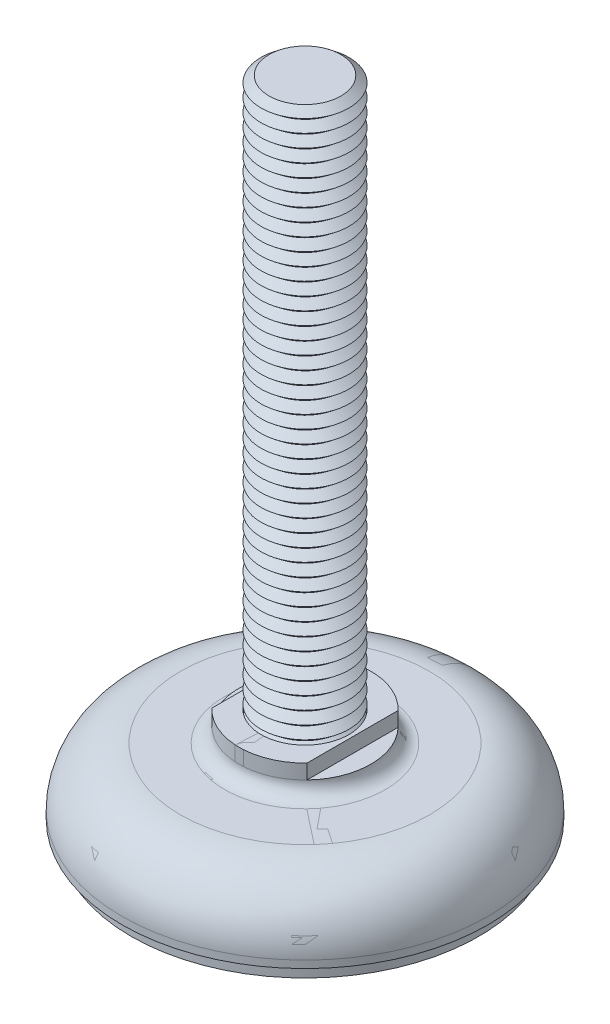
ISO-10303-21;
HEADER;
FILE_DESCRIPTION(('STEP AP214'),'2;1');
FILE_NAME('part.step','',(''),(''),'','','');
FILE_SCHEMA(('AUTOMOTIVE_DESIGN { 1 0 10303 214 1 1 1 1 }'));
ENDSEC;
DATA;
#1=APPLICATION_CONTEXT('core data for automotive mechanical design processes');
#2=APPLICATION_PROTOCOL_DEFINITION('international standard','automotive_design',2000,#1);
#3=PRODUCT_CONTEXT('',#1,'mechanical');
#4=PRODUCT('Part','Part','',(#3));
#5=PRODUCT_RELATED_PRODUCT_CATEGORY('part','',(#4));
#6=PRODUCT_DEFINITION_FORMATION('','',#4);
#7=PRODUCT_DEFINITION_CONTEXT('part definition',#1,'design');
#8=PRODUCT_DEFINITION('design','',#6,#7);
#9=PRODUCT_DEFINITION_SHAPE('','',#8);
#10=(LENGTH_UNIT() NAMED_UNIT(*) SI_UNIT(.MILLI.,.METRE.));
#11=(NAMED_UNIT(*) PLANE_ANGLE_UNIT() SI_UNIT($,.RADIAN.));
#12=(NAMED_UNIT(*) SI_UNIT($,.STERADIAN.) SOLID_ANGLE_UNIT());
#13=UNCERTAINTY_MEASURE_WITH_UNIT(LENGTH_MEASURE(1.E-05),#10,'distance_accuracy_value','');
#14=(GEOMETRIC_REPRESENTATION_CONTEXT(3) GLOBAL_UNCERTAINTY_ASSIGNED_CONTEXT((#13)) GLOBAL_UNIT_ASSIGNED_CONTEXT((#10,
#11,#12)) REPRESENTATION_CONTEXT('',''));
#15=CARTESIAN_POINT('',(0.,0.,0.));
#16=DIRECTION('',(0.,0.,1.));
#17=DIRECTION('',(1.,0.,0.));
#18=AXIS2_PLACEMENT_3D('',#15,#16,#17);
#19=CARTESIAN_POINT('',(0.,85.25,0.));
#20=DIRECTION('',(0.,-1.,0.));
#21=DIRECTION('',(0.998136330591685,0.,-0.0610234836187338));
#22=AXIS2_PLACEMENT_3D('',#19,#20,#21);
#23=CONICAL_SURFACE('',#22,4.90712535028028,0.895664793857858);
#24=CARTESIAN_POINT('',(0.,84.375,0.));
#25=DIRECTION('',(0.,-1.,0.));
#26=DIRECTION('',(0.998136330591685,0.,-0.0610234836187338));
#27=AXIS2_PLACEMENT_3D('',#24,#25,#26);
#28=CIRCLE('',#27,6.);
#29=CARTESIAN_POINT('',(5.98881798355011,84.375,-0.366140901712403));
#30=VERTEX_POINT('',#29);
#31=EDGE_CURVE('P0_E37',#30,#30,#28,.T.);
#32=ORIENTED_EDGE('',*,*,#31,.F.);
#33=EDGE_LOOP('',(#32));
#34=FACE_BOUND('',#33,.T.);
#35=CARTESIAN_POINT('',(0.,85.25,0.));
#36=DIRECTION('',(0.,-1.,0.));
#37=DIRECTION('',(0.998136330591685,0.,-0.0610234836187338));
#38=AXIS2_PLACEMENT_3D('',#35,#36,#37);
#39=CIRCLE('',#38,4.90712535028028);
#40=CARTESIAN_POINT('',(4.8979800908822,85.25,-0.299449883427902));
#41=VERTEX_POINT('',#40);
#42=EDGE_CURVE('P0_E25',#41,#41,#39,.T.);
#43=ORIENTED_EDGE('',*,*,#42,.T.);
#44=EDGE_LOOP('',(#43));
#45=FACE_BOUND('',#44,.T.);
#46=ADVANCED_FACE('P0_F14',(#34,#45),#23,.T.);
#47=CARTESIAN_POINT('',(0.,86.125,0.));
#48=DIRECTION('',(0.,1.,0.));
#49=DIRECTION('',(-0.998136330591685,0.,0.0610234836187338));
#50=AXIS2_PLACEMENT_3D('',#47,#48,#49);
#51=CONICAL_SURFACE('',#50,6.,0.895664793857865);
#52=ORIENTED_EDGE('',*,*,#42,.F.);
#53=EDGE_LOOP('',(#52));
#54=FACE_BOUND('',#53,.T.);
#55=CARTESIAN_POINT('',(0.,86.125,0.));
#56=DIRECTION('',(0.,-1.,0.));
#57=DIRECTION('',(0.998136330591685,0.,-0.0610234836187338));
#58=AXIS2_PLACEMENT_3D('',#55,#56,#57);
#59=CIRCLE('',#58,6.);
#60=CARTESIAN_POINT('',(5.98881798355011,86.125,-0.366140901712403));
#61=VERTEX_POINT('',#60);
#62=EDGE_CURVE('P0_E29',#61,#61,#59,.T.);
#63=ORIENTED_EDGE('',*,*,#62,.T.);
#64=EDGE_LOOP('',(#63));
#65=FACE_BOUND('',#64,.T.);
#66=ADVANCED_FACE('P0_F853',(#54,#65),#51,.T.);
#67=CARTESIAN_POINT('',(0.,87.,0.));
#68=DIRECTION('',(0.,1.,0.));
#69=DIRECTION('',(-0.998136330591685,0.,0.0610234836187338));
#70=AXIS2_PLACEMENT_3D('',#67,#68,#69);
#71=PLANE('',#70);
#72=CARTESIAN_POINT('',(0.,87.,0.));
#73=DIRECTION('',(0.,-1.,0.));
#74=DIRECTION('',(0.998136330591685,0.,-0.0610234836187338));
#75=AXIS2_PLACEMENT_3D('',#72,#73,#74);
#76=CIRCLE('',#75,4.90712535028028);
#77=CARTESIAN_POINT('',(4.8979800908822,87.,-0.299449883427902));
#78=VERTEX_POINT('',#77);
#79=EDGE_CURVE('P0_E21',#78,#78,#76,.T.);
#80=ORIENTED_EDGE('',*,*,#79,.F.);
#81=EDGE_LOOP('',(#80));
#82=FACE_BOUND('',#81,.T.);
#83=ADVANCED_FACE('P0_F859',(#82),#71,.T.);
#84=CARTESIAN_POINT('',(0.,87.,0.));
#85=DIRECTION('',(0.,-1.,0.));
#86=DIRECTION('',(0.998136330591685,0.,-0.0610234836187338));
#87=AXIS2_PLACEMENT_3D('',#84,#85,#86);
#88=CONICAL_SURFACE('',#87,4.90712535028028,0.895664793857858);
#89=ORIENTED_EDGE('',*,*,#62,.F.);
#90=EDGE_LOOP('',(#89));
#91=FACE_BOUND('',#90,.T.);
#92=ORIENTED_EDGE('',*,*,#79,.T.);
#93=EDGE_LOOP('',(#92));
#94=FACE_BOUND('',#93,.T.);
#95=ADVANCED_FACE('P0_F842',(#91,#94),#88,.T.);
#96=CARTESIAN_POINT('',(0.,83.5,0.));
#97=DIRECTION('',(0.,-1.,0.));
#98=DIRECTION('',(0.998136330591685,0.,-0.0610234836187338));
#99=AXIS2_PLACEMENT_3D('',#96,#97,#98);
#100=CONICAL_SURFACE('',#99,4.90712535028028,0.895664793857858);
#101=CARTESIAN_POINT('',(0.,82.625,0.));
#102=DIRECTION('',(0.,-1.,0.));
#103=DIRECTION('',(0.998136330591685,0.,-0.0610234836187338));
#104=AXIS2_PLACEMENT_3D('',#101,#102,#103);
#105=CIRCLE('',#104,6.);
#106=CARTESIAN_POINT('',(5.98881798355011,82.625,-0.366140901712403));
#107=VERTEX_POINT('',#106);
#108=EDGE_CURVE('P0_E43',#107,#107,#105,.T.);
#109=ORIENTED_EDGE('',*,*,#108,.F.);
#110=EDGE_LOOP('',(#109));
#111=FACE_BOUND('',#110,.T.);
#112=CARTESIAN_POINT('',(0.,83.5,0.));
#113=DIRECTION('',(0.,-1.,0.));
#114=DIRECTION('',(0.998136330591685,0.,-0.0610234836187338));
#115=AXIS2_PLACEMENT_3D('',#112,#113,#114);
#116=CIRCLE('',#115,4.90712535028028);
#117=CARTESIAN_POINT('',(4.8979800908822,83.5,-0.299449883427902));
#118=VERTEX_POINT('',#117);
#119=EDGE_CURVE('P0_E34',#118,#118,#116,.T.);
#120=ORIENTED_EDGE('',*,*,#119,.T.);
#121=EDGE_LOOP('',(#120));
#122=FACE_BOUND('',#121,.T.);
#123=ADVANCED_FACE('P0_F839',(#111,#122),#100,.T.);
#124=CARTESIAN_POINT('',(0.,84.375,0.));
#125=DIRECTION('',(0.,1.,0.));
#126=DIRECTION('',(-0.998136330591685,0.,0.0610234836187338));
#127=AXIS2_PLACEMENT_3D('',#124,#125,#126);
#128=CONICAL_SURFACE('',#127,6.,0.895664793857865);
#129=ORIENTED_EDGE('',*,*,#119,.F.);
#130=EDGE_LOOP('',(#129));
#131=FACE_BOUND('',#130,.T.);
#132=ORIENTED_EDGE('',*,*,#31,.T.);
#133=EDGE_LOOP('',(#132));
#134=FACE_BOUND('',#133,.T.);
#135=ADVANCED_FACE('P0_F830',(#131,#134),#128,.T.);
#136=CARTESIAN_POINT('',(0.,81.75,0.));
#137=DIRECTION('',(0.,-1.,0.));
#138=DIRECTION('',(0.998136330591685,0.,-0.0610234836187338));
#139=AXIS2_PLACEMENT_3D('',#136,#137,#138);
#140=CONICAL_SURFACE('',#139,4.90712535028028,0.895664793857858);
#141=CARTESIAN_POINT('',(0.,80.875,0.));
#142=DIRECTION('',(0.,-1.,0.));
#143=DIRECTION('',(0.998136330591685,0.,-0.0610234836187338));
#144=AXIS2_PLACEMENT_3D('',#141,#142,#143);
#145=CIRCLE('',#144,6.);
#146=CARTESIAN_POINT('',(5.98881798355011,80.875,-0.366140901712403));
#147=VERTEX_POINT('',#146);
#148=EDGE_CURVE('P0_E49',#147,#147,#145,.T.);
#149=ORIENTED_EDGE('',*,*,#148,.F.);
#150=EDGE_LOOP('',(#149));
#151=FACE_BOUND('',#150,.T.);
#152=CARTESIAN_POINT('',(0.,81.75,0.));
#153=DIRECTION('',(0.,-1.,0.));
#154=DIRECTION('',(0.998136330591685,0.,-0.0610234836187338));
#155=AXIS2_PLACEMENT_3D('',#152,#153,#154);
#156=CIRCLE('',#155,4.90712535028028);
#157=CARTESIAN_POINT('',(4.8979800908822,81.75,-0.299449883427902));
#158=VERTEX_POINT('',#157);
#159=EDGE_CURVE('P0_E40',#158,#158,#156,.T.);
#160=ORIENTED_EDGE('',*,*,#159,.T.);
#161=EDGE_LOOP('',(#160));
#162=FACE_BOUND('',#161,.T.);
#163=ADVANCED_FACE('P0_F827',(#151,#162),#140,.T.);
#164=CARTESIAN_POINT('',(0.,82.625,0.));
#165=DIRECTION('',(0.,1.,0.));
#166=DIRECTION('',(-0.998136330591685,0.,0.0610234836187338));
#167=AXIS2_PLACEMENT_3D('',#164,#165,#166);
#168=CONICAL_SURFACE('',#167,6.,0.895664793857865);
#169=ORIENTED_EDGE('',*,*,#159,.F.);
#170=EDGE_LOOP('',(#169));
#171=FACE_BOUND('',#170,.T.);
#172=ORIENTED_EDGE('',*,*,#108,.T.);
#173=EDGE_LOOP('',(#172));
#174=FACE_BOUND('',#173,.T.);
#175=ADVANCED_FACE('P0_F818',(#171,#174),#168,.T.);
#176=CARTESIAN_POINT('',(0.,80.,0.));
#177=DIRECTION('',(0.,-1.,0.));
#178=DIRECTION('',(0.998136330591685,0.,-0.0610234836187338));
#179=AXIS2_PLACEMENT_3D('',#176,#177,#178);
#180=CONICAL_SURFACE('',#179,4.90712535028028,0.895664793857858);
#181=CARTESIAN_POINT('',(0.,79.125,0.));
#182=DIRECTION('',(0.,-1.,0.));
#183=DIRECTION('',(0.998136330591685,0.,-0.0610234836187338));
#184=AXIS2_PLACEMENT_3D('',#181,#182,#183);
#185=CIRCLE('',#184,6.);
#186=CARTESIAN_POINT('',(5.98881798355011,79.125,-0.366140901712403));
#187=VERTEX_POINT('',#186);
#188=EDGE_CURVE('P0_E55',#187,#187,#185,.T.);
#189=ORIENTED_EDGE('',*,*,#188,.F.);
#190=EDGE_LOOP('',(#189));
#191=FACE_BOUND('',#190,.T.);
#192=CARTESIAN_POINT('',(0.,80.,0.));
#193=DIRECTION('',(0.,-1.,0.));
#194=DIRECTION('',(0.998136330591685,0.,-0.0610234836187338));
#195=AXIS2_PLACEMENT_3D('',#192,#193,#194);
#196=CIRCLE('',#195,4.90712535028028);
#197=CARTESIAN_POINT('',(4.8979800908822,80.,-0.299449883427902));
#198=VERTEX_POINT('',#197);
#199=EDGE_CURVE('P0_E46',#198,#198,#196,.T.);
#200=ORIENTED_EDGE('',*,*,#199,.T.);
#201=EDGE_LOOP('',(#200));
#202=FACE_BOUND('',#201,.T.);
#203=ADVANCED_FACE('P0_F815',(#191,#202),#180,.T.);
#204=CARTESIAN_POINT('',(0.,80.875,0.));
#205=DIRECTION('',(0.,1.,0.));
#206=DIRECTION('',(-0.998136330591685,0.,0.0610234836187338));
#207=AXIS2_PLACEMENT_3D('',#204,#205,#206);
#208=CONICAL_SURFACE('',#207,6.,0.895664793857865);
#209=ORIENTED_EDGE('',*,*,#199,.F.);
#210=EDGE_LOOP('',(#209));
#211=FACE_BOUND('',#210,.T.);
#212=ORIENTED_EDGE('',*,*,#148,.T.);
#213=EDGE_LOOP('',(#212));
#214=FACE_BOUND('',#213,.T.);
#215=ADVANCED_FACE('P0_F806',(#211,#214),#208,.T.);
#216=CARTESIAN_POINT('',(0.,78.25,0.));
#217=DIRECTION('',(0.,-1.,0.));
#218=DIRECTION('',(0.998136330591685,0.,-0.0610234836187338));
#219=AXIS2_PLACEMENT_3D('',#216,#217,#218);
#220=CONICAL_SURFACE('',#219,4.90712535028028,0.895664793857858);
#221=CARTESIAN_POINT('',(0.,77.375,0.));
#222=DIRECTION('',(0.,-1.,0.));
#223=DIRECTION('',(0.998136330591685,0.,-0.0610234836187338));
#224=AXIS2_PLACEMENT_3D('',#221,#222,#223);
#225=CIRCLE('',#224,6.);
#226=CARTESIAN_POINT('',(5.98881798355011,77.375,-0.366140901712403));
#227=VERTEX_POINT('',#226);
#228=EDGE_CURVE('P0_E61',#227,#227,#225,.T.);
#229=ORIENTED_EDGE('',*,*,#228,.F.);
#230=EDGE_LOOP('',(#229));
#231=FACE_BOUND('',#230,.T.);
#232=CARTESIAN_POINT('',(0.,78.25,0.));
#233=DIRECTION('',(0.,-1.,0.));
#234=DIRECTION('',(0.998136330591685,0.,-0.0610234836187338));
#235=AXIS2_PLACEMENT_3D('',#232,#233,#234);
#236=CIRCLE('',#235,4.90712535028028);
#237=CARTESIAN_POINT('',(4.8979800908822,78.25,-0.299449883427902));
#238=VERTEX_POINT('',#237);
#239=EDGE_CURVE('P0_E52',#238,#238,#236,.T.);
#240=ORIENTED_EDGE('',*,*,#239,.T.);
#241=EDGE_LOOP('',(#240));
#242=FACE_BOUND('',#241,.T.);
#243=ADVANCED_FACE('P0_F803',(#231,#242),#220,.T.);
#244=CARTESIAN_POINT('',(0.,79.125,0.));
#245=DIRECTION('',(0.,1.,0.));
#246=DIRECTION('',(-0.998136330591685,0.,0.0610234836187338));
#247=AXIS2_PLACEMENT_3D('',#244,#245,#246);
#248=CONICAL_SURFACE('',#247,6.,0.895664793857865);
#249=ORIENTED_EDGE('',*,*,#239,.F.);
#250=EDGE_LOOP('',(#249));
#251=FACE_BOUND('',#250,.T.);
#252=ORIENTED_EDGE('',*,*,#188,.T.);
#253=EDGE_LOOP('',(#252));
#254=FACE_BOUND('',#253,.T.);
#255=ADVANCED_FACE('P0_F794',(#251,#254),#248,.T.);
#256=CARTESIAN_POINT('',(0.,76.5,0.));
#257=DIRECTION('',(0.,-1.,0.));
#258=DIRECTION('',(0.998136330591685,0.,-0.0610234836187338));
#259=AXIS2_PLACEMENT_3D('',#256,#257,#258);
#260=CONICAL_SURFACE('',#259,4.90712535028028,0.895664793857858);
#261=CARTESIAN_POINT('',(0.,75.625,0.));
#262=DIRECTION('',(0.,-1.,0.));
#263=DIRECTION('',(0.998136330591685,0.,-0.0610234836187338));
#264=AXIS2_PLACEMENT_3D('',#261,#262,#263);
#265=CIRCLE('',#264,6.);
#266=CARTESIAN_POINT('',(5.98881798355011,75.625,-0.366140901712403));
#267=VERTEX_POINT('',#266);
#268=EDGE_CURVE('P0_E67',#267,#267,#265,.T.);
#269=ORIENTED_EDGE('',*,*,#268,.F.);
#270=EDGE_LOOP('',(#269));
#271=FACE_BOUND('',#270,.T.);
#272=CARTESIAN_POINT('',(0.,76.5,0.));
#273=DIRECTION('',(0.,-1.,0.));
#274=DIRECTION('',(0.998136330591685,0.,-0.0610234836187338));
#275=AXIS2_PLACEMENT_3D('',#272,#273,#274);
#276=CIRCLE('',#275,4.90712535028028);
#277=CARTESIAN_POINT('',(4.8979800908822,76.5,-0.299449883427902));
#278=VERTEX_POINT('',#277);
#279=EDGE_CURVE('P0_E58',#278,#278,#276,.T.);
#280=ORIENTED_EDGE('',*,*,#279,.T.);
#281=EDGE_LOOP('',(#280));
#282=FACE_BOUND('',#281,.T.);
#283=ADVANCED_FACE('P0_F791',(#271,#282),#260,.T.);
#284=CARTESIAN_POINT('',(0.,77.375,0.));
#285=DIRECTION('',(0.,1.,0.));
#286=DIRECTION('',(-0.998136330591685,0.,0.0610234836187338));
#287=AXIS2_PLACEMENT_3D('',#284,#285,#286);
#288=CONICAL_SURFACE('',#287,6.,0.895664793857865);
#289=ORIENTED_EDGE('',*,*,#279,.F.);
#290=EDGE_LOOP('',(#289));
#291=FACE_BOUND('',#290,.T.);
#292=ORIENTED_EDGE('',*,*,#228,.T.);
#293=EDGE_LOOP('',(#292));
#294=FACE_BOUND('',#293,.T.);
#295=ADVANCED_FACE('P0_F782',(#291,#294),#288,.T.);
#296=CARTESIAN_POINT('',(0.,74.75,0.));
#297=DIRECTION('',(0.,-1.,0.));
#298=DIRECTION('',(0.998136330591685,0.,-0.0610234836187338));
#299=AXIS2_PLACEMENT_3D('',#296,#297,#298);
#300=CONICAL_SURFACE('',#299,4.90712535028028,0.895664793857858);
#301=CARTESIAN_POINT('',(0.,73.875,0.));
#302=DIRECTION('',(0.,-1.,0.));
#303=DIRECTION('',(0.998136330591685,0.,-0.0610234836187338));
#304=AXIS2_PLACEMENT_3D('',#301,#302,#303);
#305=CIRCLE('',#304,6.);
#306=CARTESIAN_POINT('',(5.98881798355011,73.875,-0.366140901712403));
#307=VERTEX_POINT('',#306);
#308=EDGE_CURVE('P0_E73',#307,#307,#305,.T.);
#309=ORIENTED_EDGE('',*,*,#308,.F.);
#310=EDGE_LOOP('',(#309));
#311=FACE_BOUND('',#310,.T.);
#312=CARTESIAN_POINT('',(0.,74.75,0.));
#313=DIRECTION('',(0.,-1.,0.));
#314=DIRECTION('',(0.998136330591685,0.,-0.0610234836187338));
#315=AXIS2_PLACEMENT_3D('',#312,#313,#314);
#316=CIRCLE('',#315,4.90712535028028);
#317=CARTESIAN_POINT('',(4.8979800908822,74.75,-0.299449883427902));
#318=VERTEX_POINT('',#317);
#319=EDGE_CURVE('P0_E64',#318,#318,#316,.T.);
#320=ORIENTED_EDGE('',*,*,#319,.T.);
#321=EDGE_LOOP('',(#320));
#322=FACE_BOUND('',#321,.T.);
#323=ADVANCED_FACE('P0_F779',(#311,#322),#300,.T.);
#324=CARTESIAN_POINT('',(0.,75.625,0.));
#325=DIRECTION('',(0.,1.,0.));
#326=DIRECTION('',(-0.998136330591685,0.,0.0610234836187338));
#327=AXIS2_PLACEMENT_3D('',#324,#325,#326);
#328=CONICAL_SURFACE('',#327,6.,0.895664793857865);
#329=ORIENTED_EDGE('',*,*,#319,.F.);
#330=EDGE_LOOP('',(#329));
#331=FACE_BOUND('',#330,.T.);
#332=ORIENTED_EDGE('',*,*,#268,.T.);
#333=EDGE_LOOP('',(#332));
#334=FACE_BOUND('',#333,.T.);
#335=ADVANCED_FACE('P0_F770',(#331,#334),#328,.T.);
#336=CARTESIAN_POINT('',(0.,73.,0.));
#337=DIRECTION('',(0.,-1.,0.));
#338=DIRECTION('',(0.998136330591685,0.,-0.0610234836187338));
#339=AXIS2_PLACEMENT_3D('',#336,#337,#338);
#340=CONICAL_SURFACE('',#339,4.90712535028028,0.895664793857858);
#341=CARTESIAN_POINT('',(0.,72.125,0.));
#342=DIRECTION('',(0.,-1.,0.));
#343=DIRECTION('',(0.998136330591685,0.,-0.0610234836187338));
#344=AXIS2_PLACEMENT_3D('',#341,#342,#343);
#345=CIRCLE('',#344,6.);
#346=CARTESIAN_POINT('',(5.98881798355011,72.125,-0.366140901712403));
#347=VERTEX_POINT('',#346);
#348=EDGE_CURVE('P0_E79',#347,#347,#345,.T.);
#349=ORIENTED_EDGE('',*,*,#348,.F.);
#350=EDGE_LOOP('',(#349));
#351=FACE_BOUND('',#350,.T.);
#352=CARTESIAN_POINT('',(0.,73.,0.));
#353=DIRECTION('',(0.,-1.,0.));
#354=DIRECTION('',(0.998136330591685,0.,-0.0610234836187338));
#355=AXIS2_PLACEMENT_3D('',#352,#353,#354);
#356=CIRCLE('',#355,4.90712535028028);
#357=CARTESIAN_POINT('',(4.8979800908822,73.,-0.299449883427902));
#358=VERTEX_POINT('',#357);
#359=EDGE_CURVE('P0_E70',#358,#358,#356,.T.);
#360=ORIENTED_EDGE('',*,*,#359,.T.);
#361=EDGE_LOOP('',(#360));
#362=FACE_BOUND('',#361,.T.);
#363=ADVANCED_FACE('P0_F767',(#351,#362),#340,.T.);
#364=CARTESIAN_POINT('',(0.,73.875,0.));
#365=DIRECTION('',(0.,1.,0.));
#366=DIRECTION('',(-0.998136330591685,0.,0.0610234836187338));
#367=AXIS2_PLACEMENT_3D('',#364,#365,#366);
#368=CONICAL_SURFACE('',#367,6.,0.895664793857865);
#369=ORIENTED_EDGE('',*,*,#359,.F.);
#370=EDGE_LOOP('',(#369));
#371=FACE_BOUND('',#370,.T.);
#372=ORIENTED_EDGE('',*,*,#308,.T.);
#373=EDGE_LOOP('',(#372));
#374=FACE_BOUND('',#373,.T.);
#375=ADVANCED_FACE('P0_F758',(#371,#374),#368,.T.);
#376=CARTESIAN_POINT('',(0.,71.25,0.));
#377=DIRECTION('',(0.,-1.,0.));
#378=DIRECTION('',(0.998136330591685,0.,-0.0610234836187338));
#379=AXIS2_PLACEMENT_3D('',#376,#377,#378);
#380=CONICAL_SURFACE('',#379,4.90712535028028,0.895664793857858);
#381=CARTESIAN_POINT('',(0.,70.375,0.));
#382=DIRECTION('',(0.,-1.,0.));
#383=DIRECTION('',(0.998136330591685,0.,-0.0610234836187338));
#384=AXIS2_PLACEMENT_3D('',#381,#382,#383);
#385=CIRCLE('',#384,6.);
#386=CARTESIAN_POINT('',(5.98881798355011,70.375,-0.366140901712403));
#387=VERTEX_POINT('',#386);
#388=EDGE_CURVE('P0_E85',#387,#387,#385,.T.);
#389=ORIENTED_EDGE('',*,*,#388,.F.);
#390=EDGE_LOOP('',(#389));
#391=FACE_BOUND('',#390,.T.);
#392=CARTESIAN_POINT('',(0.,71.25,0.));
#393=DIRECTION('',(0.,-1.,0.));
#394=DIRECTION('',(0.998136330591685,0.,-0.0610234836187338));
#395=AXIS2_PLACEMENT_3D('',#392,#393,#394);
#396=CIRCLE('',#395,4.90712535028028);
#397=CARTESIAN_POINT('',(4.8979800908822,71.25,-0.299449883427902));
#398=VERTEX_POINT('',#397);
#399=EDGE_CURVE('P0_E76',#398,#398,#396,.T.);
#400=ORIENTED_EDGE('',*,*,#399,.T.);
#401=EDGE_LOOP('',(#400));
#402=FACE_BOUND('',#401,.T.);
#403=ADVANCED_FACE('P0_F755',(#391,#402),#380,.T.);
#404=CARTESIAN_POINT('',(0.,72.125,0.));
#405=DIRECTION('',(0.,1.,0.));
#406=DIRECTION('',(-0.998136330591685,0.,0.0610234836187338));
#407=AXIS2_PLACEMENT_3D('',#404,#405,#406);
#408=CONICAL_SURFACE('',#407,6.,0.895664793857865);
#409=ORIENTED_EDGE('',*,*,#399,.F.);
#410=EDGE_LOOP('',(#409));
#411=FACE_BOUND('',#410,.T.);
#412=ORIENTED_EDGE('',*,*,#348,.T.);
#413=EDGE_LOOP('',(#412));
#414=FACE_BOUND('',#413,.T.);
#415=ADVANCED_FACE('P0_F746',(#411,#414),#408,.T.);
#416=CARTESIAN_POINT('',(0.,69.5,0.));
#417=DIRECTION('',(0.,-1.,0.));
#418=DIRECTION('',(0.998136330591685,0.,-0.0610234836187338));
#419=AXIS2_PLACEMENT_3D('',#416,#417,#418);
#420=CONICAL_SURFACE('',#419,4.90712535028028,0.895664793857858);
#421=CARTESIAN_POINT('',(0.,68.625,0.));
#422=DIRECTION('',(0.,-1.,0.));
#423=DIRECTION('',(0.998136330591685,0.,-0.0610234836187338));
#424=AXIS2_PLACEMENT_3D('',#421,#422,#423);
#425=CIRCLE('',#424,6.);
#426=CARTESIAN_POINT('',(5.98881798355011,68.625,-0.366140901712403));
#427=VERTEX_POINT('',#426);
#428=EDGE_CURVE('P0_E91',#427,#427,#425,.T.);
#429=ORIENTED_EDGE('',*,*,#428,.F.);
#430=EDGE_LOOP('',(#429));
#431=FACE_BOUND('',#430,.T.);
#432=CARTESIAN_POINT('',(0.,69.5,0.));
#433=DIRECTION('',(0.,-1.,0.));
#434=DIRECTION('',(0.998136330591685,0.,-0.0610234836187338));
#435=AXIS2_PLACEMENT_3D('',#432,#433,#434);
#436=CIRCLE('',#435,4.90712535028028);
#437=CARTESIAN_POINT('',(4.8979800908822,69.5,-0.299449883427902));
#438=VERTEX_POINT('',#437);
#439=EDGE_CURVE('P0_E82',#438,#438,#436,.T.);
#440=ORIENTED_EDGE('',*,*,#439,.T.);
#441=EDGE_LOOP('',(#440));
#442=FACE_BOUND('',#441,.T.);
#443=ADVANCED_FACE('P0_F743',(#431,#442),#420,.T.);
#444=CARTESIAN_POINT('',(0.,70.375,0.));
#445=DIRECTION('',(0.,1.,0.));
#446=DIRECTION('',(-0.998136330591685,0.,0.0610234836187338));
#447=AXIS2_PLACEMENT_3D('',#444,#445,#446);
#448=CONICAL_SURFACE('',#447,6.,0.895664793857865);
#449=ORIENTED_EDGE('',*,*,#439,.F.);
#450=EDGE_LOOP('',(#449));
#451=FACE_BOUND('',#450,.T.);
#452=ORIENTED_EDGE('',*,*,#388,.T.);
#453=EDGE_LOOP('',(#452));
#454=FACE_BOUND('',#453,.T.);
#455=ADVANCED_FACE('P0_F734',(#451,#454),#448,.T.);
#456=CARTESIAN_POINT('',(0.,67.75,0.));
#457=DIRECTION('',(0.,-1.,0.));
#458=DIRECTION('',(0.998136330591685,0.,-0.0610234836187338));
#459=AXIS2_PLACEMENT_3D('',#456,#457,#458);
#460=CONICAL_SURFACE('',#459,4.90712535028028,0.895664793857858);
#461=CARTESIAN_POINT('',(0.,66.875,0.));
#462=DIRECTION('',(0.,-1.,0.));
#463=DIRECTION('',(0.998136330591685,0.,-0.0610234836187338));
#464=AXIS2_PLACEMENT_3D('',#461,#462,#463);
#465=CIRCLE('',#464,6.);
#466=CARTESIAN_POINT('',(5.98881798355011,66.875,-0.366140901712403));
#467=VERTEX_POINT('',#466);
#468=EDGE_CURVE('P0_E97',#467,#467,#465,.T.);
#469=ORIENTED_EDGE('',*,*,#468,.F.);
#470=EDGE_LOOP('',(#469));
#471=FACE_BOUND('',#470,.T.);
#472=CARTESIAN_POINT('',(0.,67.75,0.));
#473=DIRECTION('',(0.,-1.,0.));
#474=DIRECTION('',(0.998136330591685,0.,-0.0610234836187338));
#475=AXIS2_PLACEMENT_3D('',#472,#473,#474);
#476=CIRCLE('',#475,4.90712535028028);
#477=CARTESIAN_POINT('',(4.8979800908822,67.75,-0.299449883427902));
#478=VERTEX_POINT('',#477);
#479=EDGE_CURVE('P0_E88',#478,#478,#476,.T.);
#480=ORIENTED_EDGE('',*,*,#479,.T.);
#481=EDGE_LOOP('',(#480));
#482=FACE_BOUND('',#481,.T.);
#483=ADVANCED_FACE('P0_F731',(#471,#482),#460,.T.);
#484=CARTESIAN_POINT('',(0.,68.625,0.));
#485=DIRECTION('',(0.,1.,0.));
#486=DIRECTION('',(-0.998136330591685,0.,0.0610234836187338));
#487=AXIS2_PLACEMENT_3D('',#484,#485,#486);
#488=CONICAL_SURFACE('',#487,6.,0.895664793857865);
#489=ORIENTED_EDGE('',*,*,#479,.F.);
#490=EDGE_LOOP('',(#489));
#491=FACE_BOUND('',#490,.T.);
#492=ORIENTED_EDGE('',*,*,#428,.T.);
#493=EDGE_LOOP('',(#492));
#494=FACE_BOUND('',#493,.T.);
#495=ADVANCED_FACE('P0_F722',(#491,#494),#488,.T.);
#496=CARTESIAN_POINT('',(0.,66.,0.));
#497=DIRECTION('',(0.,-1.,0.));
#498=DIRECTION('',(0.998136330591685,0.,-0.0610234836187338));
#499=AXIS2_PLACEMENT_3D('',#496,#497,#498);
#500=CONICAL_SURFACE('',#499,4.90712535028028,0.895664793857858);
#501=CARTESIAN_POINT('',(0.,65.125,0.));
#502=DIRECTION('',(0.,-1.,0.));
#503=DIRECTION('',(0.998136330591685,0.,-0.0610234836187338));
#504=AXIS2_PLACEMENT_3D('',#501,#502,#503);
#505=CIRCLE('',#504,6.);
#506=CARTESIAN_POINT('',(5.98881798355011,65.125,-0.366140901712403));
#507=VERTEX_POINT('',#506);
#508=EDGE_CURVE('P0_E103',#507,#507,#505,.T.);
#509=ORIENTED_EDGE('',*,*,#508,.F.);
#510=EDGE_LOOP('',(#509));
#511=FACE_BOUND('',#510,.T.);
#512=CARTESIAN_POINT('',(0.,66.,0.));
#513=DIRECTION('',(0.,-1.,0.));
#514=DIRECTION('',(0.998136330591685,0.,-0.0610234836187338));
#515=AXIS2_PLACEMENT_3D('',#512,#513,#514);
#516=CIRCLE('',#515,4.90712535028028);
#517=CARTESIAN_POINT('',(4.8979800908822,66.,-0.299449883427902));
#518=VERTEX_POINT('',#517);
#519=EDGE_CURVE('P0_E94',#518,#518,#516,.T.);
#520=ORIENTED_EDGE('',*,*,#519,.T.);
#521=EDGE_LOOP('',(#520));
#522=FACE_BOUND('',#521,.T.);
#523=ADVANCED_FACE('P0_F719',(#511,#522),#500,.T.);
#524=CARTESIAN_POINT('',(0.,66.875,0.));
#525=DIRECTION('',(0.,1.,0.));
#526=DIRECTION('',(-0.998136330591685,0.,0.0610234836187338));
#527=AXIS2_PLACEMENT_3D('',#524,#525,#526);
#528=CONICAL_SURFACE('',#527,6.,0.895664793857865);
#529=ORIENTED_EDGE('',*,*,#519,.F.);
#530=EDGE_LOOP('',(#529));
#531=FACE_BOUND('',#530,.T.);
#532=ORIENTED_EDGE('',*,*,#468,.T.);
#533=EDGE_LOOP('',(#532));
#534=FACE_BOUND('',#533,.T.);
#535=ADVANCED_FACE('P0_F710',(#531,#534),#528,.T.);
#536=CARTESIAN_POINT('',(0.,64.25,0.));
#537=DIRECTION('',(0.,-1.,0.));
#538=DIRECTION('',(0.998136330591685,0.,-0.0610234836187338));
#539=AXIS2_PLACEMENT_3D('',#536,#537,#538);
#540=CONICAL_SURFACE('',#539,4.90712535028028,0.895664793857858);
#541=CARTESIAN_POINT('',(0.,63.375,0.));
#542=DIRECTION('',(0.,-1.,0.));
#543=DIRECTION('',(0.998136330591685,0.,-0.0610234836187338));
#544=AXIS2_PLACEMENT_3D('',#541,#542,#543);
#545=CIRCLE('',#544,6.);
#546=CARTESIAN_POINT('',(5.98881798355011,63.375,-0.366140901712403));
#547=VERTEX_POINT('',#546);
#548=EDGE_CURVE('P0_E109',#547,#547,#545,.T.);
#549=ORIENTED_EDGE('',*,*,#548,.F.);
#550=EDGE_LOOP('',(#549));
#551=FACE_BOUND('',#550,.T.);
#552=CARTESIAN_POINT('',(0.,64.25,0.));
#553=DIRECTION('',(0.,-1.,0.));
#554=DIRECTION('',(0.998136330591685,0.,-0.0610234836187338));
#555=AXIS2_PLACEMENT_3D('',#552,#553,#554);
#556=CIRCLE('',#555,4.90712535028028);
#557=CARTESIAN_POINT('',(4.8979800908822,64.25,-0.299449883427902));
#558=VERTEX_POINT('',#557);
#559=EDGE_CURVE('P0_E100',#558,#558,#556,.T.);
#560=ORIENTED_EDGE('',*,*,#559,.T.);
#561=EDGE_LOOP('',(#560));
#562=FACE_BOUND('',#561,.T.);
#563=ADVANCED_FACE('P0_F707',(#551,#562),#540,.T.);
#564=CARTESIAN_POINT('',(0.,65.125,0.));
#565=DIRECTION('',(0.,1.,0.));
#566=DIRECTION('',(-0.998136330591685,0.,0.0610234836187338));
#567=AXIS2_PLACEMENT_3D('',#564,#565,#566);
#568=CONICAL_SURFACE('',#567,6.,0.895664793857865);
#569=ORIENTED_EDGE('',*,*,#559,.F.);
#570=EDGE_LOOP('',(#569));
#571=FACE_BOUND('',#570,.T.);
#572=ORIENTED_EDGE('',*,*,#508,.T.);
#573=EDGE_LOOP('',(#572));
#574=FACE_BOUND('',#573,.T.);
#575=ADVANCED_FACE('P0_F698',(#571,#574),#568,.T.);
#576=CARTESIAN_POINT('',(0.,62.5,0.));
#577=DIRECTION('',(0.,-1.,0.));
#578=DIRECTION('',(0.998136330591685,0.,-0.0610234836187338));
#579=AXIS2_PLACEMENT_3D('',#576,#577,#578);
#580=CONICAL_SURFACE('',#579,4.90712535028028,0.895664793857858);
#581=CARTESIAN_POINT('',(0.,61.625,0.));
#582=DIRECTION('',(0.,-1.,0.));
#583=DIRECTION('',(0.998136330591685,0.,-0.0610234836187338));
#584=AXIS2_PLACEMENT_3D('',#581,#582,#583);
#585=CIRCLE('',#584,6.);
#586=CARTESIAN_POINT('',(5.98881798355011,61.625,-0.366140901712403));
#587=VERTEX_POINT('',#586);
#588=EDGE_CURVE('P0_E115',#587,#587,#585,.T.);
#589=ORIENTED_EDGE('',*,*,#588,.F.);
#590=EDGE_LOOP('',(#589));
#591=FACE_BOUND('',#590,.T.);
#592=CARTESIAN_POINT('',(0.,62.5,0.));
#593=DIRECTION('',(0.,-1.,0.));
#594=DIRECTION('',(0.998136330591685,0.,-0.0610234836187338));
#595=AXIS2_PLACEMENT_3D('',#592,#593,#594);
#596=CIRCLE('',#595,4.90712535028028);
#597=CARTESIAN_POINT('',(4.8979800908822,62.5,-0.299449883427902));
#598=VERTEX_POINT('',#597);
#599=EDGE_CURVE('P0_E106',#598,#598,#596,.T.);
#600=ORIENTED_EDGE('',*,*,#599,.T.);
#601=EDGE_LOOP('',(#600));
#602=FACE_BOUND('',#601,.T.);
#603=ADVANCED_FACE('P0_F695',(#591,#602),#580,.T.);
#604=CARTESIAN_POINT('',(0.,63.375,0.));
#605=DIRECTION('',(0.,1.,0.));
#606=DIRECTION('',(-0.998136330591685,0.,0.0610234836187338));
#607=AXIS2_PLACEMENT_3D('',#604,#605,#606);
#608=CONICAL_SURFACE('',#607,6.,0.895664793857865);
#609=ORIENTED_EDGE('',*,*,#599,.F.);
#610=EDGE_LOOP('',(#609));
#611=FACE_BOUND('',#610,.T.);
#612=ORIENTED_EDGE('',*,*,#548,.T.);
#613=EDGE_LOOP('',(#612));
#614=FACE_BOUND('',#613,.T.);
#615=ADVANCED_FACE('P0_F686',(#611,#614),#608,.T.);
#616=CARTESIAN_POINT('',(0.,60.75,0.));
#617=DIRECTION('',(0.,-1.,0.));
#618=DIRECTION('',(0.998136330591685,0.,-0.0610234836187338));
#619=AXIS2_PLACEMENT_3D('',#616,#617,#618);
#620=CONICAL_SURFACE('',#619,4.90712535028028,0.895664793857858);
#621=CARTESIAN_POINT('',(0.,59.875,0.));
#622=DIRECTION('',(0.,-1.,0.));
#623=DIRECTION('',(0.998136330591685,0.,-0.0610234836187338));
#624=AXIS2_PLACEMENT_3D('',#621,#622,#623);
#625=CIRCLE('',#624,6.);
#626=CARTESIAN_POINT('',(5.98881798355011,59.875,-0.366140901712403));
#627=VERTEX_POINT('',#626);
#628=EDGE_CURVE('P0_E121',#627,#627,#625,.T.);
#629=ORIENTED_EDGE('',*,*,#628,.F.);
#630=EDGE_LOOP('',(#629));
#631=FACE_BOUND('',#630,.T.);
#632=CARTESIAN_POINT('',(0.,60.75,0.));
#633=DIRECTION('',(0.,-1.,0.));
#634=DIRECTION('',(0.998136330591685,0.,-0.0610234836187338));
#635=AXIS2_PLACEMENT_3D('',#632,#633,#634);
#636=CIRCLE('',#635,4.90712535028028);
#637=CARTESIAN_POINT('',(4.8979800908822,60.75,-0.299449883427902));
#638=VERTEX_POINT('',#637);
#639=EDGE_CURVE('P0_E112',#638,#638,#636,.T.);
#640=ORIENTED_EDGE('',*,*,#639,.T.);
#641=EDGE_LOOP('',(#640));
#642=FACE_BOUND('',#641,.T.);
#643=ADVANCED_FACE('P0_F683',(#631,#642),#620,.T.);
#644=CARTESIAN_POINT('',(0.,61.625,0.));
#645=DIRECTION('',(0.,1.,0.));
#646=DIRECTION('',(-0.998136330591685,0.,0.0610234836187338));
#647=AXIS2_PLACEMENT_3D('',#644,#645,#646);
#648=CONICAL_SURFACE('',#647,6.,0.895664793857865);
#649=ORIENTED_EDGE('',*,*,#639,.F.);
#650=EDGE_LOOP('',(#649));
#651=FACE_BOUND('',#650,.T.);
#652=ORIENTED_EDGE('',*,*,#588,.T.);
#653=EDGE_LOOP('',(#652));
#654=FACE_BOUND('',#653,.T.);
#655=ADVANCED_FACE('P0_F674',(#651,#654),#648,.T.);
#656=CARTESIAN_POINT('',(0.,59.,0.));
#657=DIRECTION('',(0.,-1.,0.));
#658=DIRECTION('',(0.998136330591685,0.,-0.0610234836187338));
#659=AXIS2_PLACEMENT_3D('',#656,#657,#658);
#660=CONICAL_SURFACE('',#659,4.90712535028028,0.895664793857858);
#661=CARTESIAN_POINT('',(0.,58.125,0.));
#662=DIRECTION('',(0.,-1.,0.));
#663=DIRECTION('',(0.998136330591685,0.,-0.0610234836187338));
#664=AXIS2_PLACEMENT_3D('',#661,#662,#663);
#665=CIRCLE('',#664,6.);
#666=CARTESIAN_POINT('',(5.98881798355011,58.125,-0.366140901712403));
#667=VERTEX_POINT('',#666);
#668=EDGE_CURVE('P0_E127',#667,#667,#665,.T.);
#669=ORIENTED_EDGE('',*,*,#668,.F.);
#670=EDGE_LOOP('',(#669));
#671=FACE_BOUND('',#670,.T.);
#672=CARTESIAN_POINT('',(0.,59.,0.));
#673=DIRECTION('',(0.,-1.,0.));
#674=DIRECTION('',(0.998136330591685,0.,-0.0610234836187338));
#675=AXIS2_PLACEMENT_3D('',#672,#673,#674);
#676=CIRCLE('',#675,4.90712535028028);
#677=CARTESIAN_POINT('',(4.8979800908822,59.,-0.299449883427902));
#678=VERTEX_POINT('',#677);
#679=EDGE_CURVE('P0_E118',#678,#678,#676,.T.);
#680=ORIENTED_EDGE('',*,*,#679,.T.);
#681=EDGE_LOOP('',(#680));
#682=FACE_BOUND('',#681,.T.);
#683=ADVANCED_FACE('P0_F671',(#671,#682),#660,.T.);
#684=CARTESIAN_POINT('',(0.,59.875,0.));
#685=DIRECTION('',(0.,1.,0.));
#686=DIRECTION('',(-0.998136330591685,0.,0.0610234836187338));
#687=AXIS2_PLACEMENT_3D('',#684,#685,#686);
#688=CONICAL_SURFACE('',#687,6.,0.895664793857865);
#689=ORIENTED_EDGE('',*,*,#679,.F.);
#690=EDGE_LOOP('',(#689));
#691=FACE_BOUND('',#690,.T.);
#692=ORIENTED_EDGE('',*,*,#628,.T.);
#693=EDGE_LOOP('',(#692));
#694=FACE_BOUND('',#693,.T.);
#695=ADVANCED_FACE('P0_F662',(#691,#694),#688,.T.);
#696=CARTESIAN_POINT('',(0.,57.25,0.));
#697=DIRECTION('',(0.,-1.,0.));
#698=DIRECTION('',(0.998136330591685,0.,-0.0610234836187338));
#699=AXIS2_PLACEMENT_3D('',#696,#697,#698);
#700=CONICAL_SURFACE('',#699,4.90712535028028,0.895664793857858);
#701=CARTESIAN_POINT('',(0.,56.375,0.));
#702=DIRECTION('',(0.,-1.,0.));
#703=DIRECTION('',(0.998136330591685,0.,-0.0610234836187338));
#704=AXIS2_PLACEMENT_3D('',#701,#702,#703);
#705=CIRCLE('',#704,6.);
#706=CARTESIAN_POINT('',(5.98881798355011,56.375,-0.366140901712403));
#707=VERTEX_POINT('',#706);
#708=EDGE_CURVE('P0_E133',#707,#707,#705,.T.);
#709=ORIENTED_EDGE('',*,*,#708,.F.);
#710=EDGE_LOOP('',(#709));
#711=FACE_BOUND('',#710,.T.);
#712=CARTESIAN_POINT('',(0.,57.25,0.));
#713=DIRECTION('',(0.,-1.,0.));
#714=DIRECTION('',(0.998136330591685,0.,-0.0610234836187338));
#715=AXIS2_PLACEMENT_3D('',#712,#713,#714);
#716=CIRCLE('',#715,4.90712535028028);
#717=CARTESIAN_POINT('',(4.8979800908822,57.25,-0.299449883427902));
#718=VERTEX_POINT('',#717);
#719=EDGE_CURVE('P0_E124',#718,#718,#716,.T.);
#720=ORIENTED_EDGE('',*,*,#719,.T.);
#721=EDGE_LOOP('',(#720));
#722=FACE_BOUND('',#721,.T.);
#723=ADVANCED_FACE('P0_F659',(#711,#722),#700,.T.);
#724=CARTESIAN_POINT('',(0.,58.125,0.));
#725=DIRECTION('',(0.,1.,0.));
#726=DIRECTION('',(-0.998136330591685,0.,0.0610234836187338));
#727=AXIS2_PLACEMENT_3D('',#724,#725,#726);
#728=CONICAL_SURFACE('',#727,6.,0.895664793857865);
#729=ORIENTED_EDGE('',*,*,#719,.F.);
#730=EDGE_LOOP('',(#729));
#731=FACE_BOUND('',#730,.T.);
#732=ORIENTED_EDGE('',*,*,#668,.T.);
#733=EDGE_LOOP('',(#732));
#734=FACE_BOUND('',#733,.T.);
#735=ADVANCED_FACE('P0_F650',(#731,#734),#728,.T.);
#736=CARTESIAN_POINT('',(0.,55.5,0.));
#737=DIRECTION('',(0.,-1.,0.));
#738=DIRECTION('',(0.998136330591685,0.,-0.0610234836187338));
#739=AXIS2_PLACEMENT_3D('',#736,#737,#738);
#740=CONICAL_SURFACE('',#739,4.90712535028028,0.895664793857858);
#741=CARTESIAN_POINT('',(0.,54.625,0.));
#742=DIRECTION('',(0.,-1.,0.));
#743=DIRECTION('',(0.998136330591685,0.,-0.0610234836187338));
#744=AXIS2_PLACEMENT_3D('',#741,#742,#743);
#745=CIRCLE('',#744,6.);
#746=CARTESIAN_POINT('',(5.98881798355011,54.625,-0.366140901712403));
#747=VERTEX_POINT('',#746);
#748=EDGE_CURVE('P0_E139',#747,#747,#745,.T.);
#749=ORIENTED_EDGE('',*,*,#748,.F.);
#750=EDGE_LOOP('',(#749));
#751=FACE_BOUND('',#750,.T.);
#752=CARTESIAN_POINT('',(0.,55.5,0.));
#753=DIRECTION('',(0.,-1.,0.));
#754=DIRECTION('',(0.998136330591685,0.,-0.0610234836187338));
#755=AXIS2_PLACEMENT_3D('',#752,#753,#754);
#756=CIRCLE('',#755,4.90712535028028);
#757=CARTESIAN_POINT('',(4.8979800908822,55.5,-0.299449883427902));
#758=VERTEX_POINT('',#757);
#759=EDGE_CURVE('P0_E130',#758,#758,#756,.T.);
#760=ORIENTED_EDGE('',*,*,#759,.T.);
#761=EDGE_LOOP('',(#760));
#762=FACE_BOUND('',#761,.T.);
#763=ADVANCED_FACE('P0_F647',(#751,#762),#740,.T.);
#764=CARTESIAN_POINT('',(0.,56.375,0.));
#765=DIRECTION('',(0.,1.,0.));
#766=DIRECTION('',(-0.998136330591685,0.,0.0610234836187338));
#767=AXIS2_PLACEMENT_3D('',#764,#765,#766);
#768=CONICAL_SURFACE('',#767,6.,0.895664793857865);
#769=ORIENTED_EDGE('',*,*,#759,.F.);
#770=EDGE_LOOP('',(#769));
#771=FACE_BOUND('',#770,.T.);
#772=ORIENTED_EDGE('',*,*,#708,.T.);
#773=EDGE_LOOP('',(#772));
#774=FACE_BOUND('',#773,.T.);
#775=ADVANCED_FACE('P0_F638',(#771,#774),#768,.T.);
#776=CARTESIAN_POINT('',(0.,53.75,0.));
#777=DIRECTION('',(0.,-1.,0.));
#778=DIRECTION('',(0.998136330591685,0.,-0.0610234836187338));
#779=AXIS2_PLACEMENT_3D('',#776,#777,#778);
#780=CONICAL_SURFACE('',#779,4.90712535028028,0.895664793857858);
#781=CARTESIAN_POINT('',(0.,52.875,0.));
#782=DIRECTION('',(0.,-1.,0.));
#783=DIRECTION('',(0.998136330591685,0.,-0.0610234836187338));
#784=AXIS2_PLACEMENT_3D('',#781,#782,#783);
#785=CIRCLE('',#784,6.);
#786=CARTESIAN_POINT('',(5.98881798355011,52.875,-0.366140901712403));
#787=VERTEX_POINT('',#786);
#788=EDGE_CURVE('P0_E145',#787,#787,#785,.T.);
#789=ORIENTED_EDGE('',*,*,#788,.F.);
#790=EDGE_LOOP('',(#789));
#791=FACE_BOUND('',#790,.T.);
#792=CARTESIAN_POINT('',(0.,53.75,0.));
#793=DIRECTION('',(0.,-1.,0.));
#794=DIRECTION('',(0.998136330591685,0.,-0.0610234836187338));
#795=AXIS2_PLACEMENT_3D('',#792,#793,#794);
#796=CIRCLE('',#795,4.90712535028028);
#797=CARTESIAN_POINT('',(4.8979800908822,53.75,-0.299449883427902));
#798=VERTEX_POINT('',#797);
#799=EDGE_CURVE('P0_E136',#798,#798,#796,.T.);
#800=ORIENTED_EDGE('',*,*,#799,.T.);
#801=EDGE_LOOP('',(#800));
#802=FACE_BOUND('',#801,.T.);
#803=ADVANCED_FACE('P0_F635',(#791,#802),#780,.T.);
#804=CARTESIAN_POINT('',(0.,54.625,0.));
#805=DIRECTION('',(0.,1.,0.));
#806=DIRECTION('',(-0.998136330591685,0.,0.0610234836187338));
#807=AXIS2_PLACEMENT_3D('',#804,#805,#806);
#808=CONICAL_SURFACE('',#807,6.,0.895664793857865);
#809=ORIENTED_EDGE('',*,*,#799,.F.);
#810=EDGE_LOOP('',(#809));
#811=FACE_BOUND('',#810,.T.);
#812=ORIENTED_EDGE('',*,*,#748,.T.);
#813=EDGE_LOOP('',(#812));
#814=FACE_BOUND('',#813,.T.);
#815=ADVANCED_FACE('P0_F626',(#811,#814),#808,.T.);
#816=CARTESIAN_POINT('',(0.,52.,0.));
#817=DIRECTION('',(0.,-1.,0.));
#818=DIRECTION('',(0.998136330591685,0.,-0.0610234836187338));
#819=AXIS2_PLACEMENT_3D('',#816,#817,#818);
#820=CONICAL_SURFACE('',#819,4.90712535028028,0.895664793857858);
#821=CARTESIAN_POINT('',(0.,51.125,0.));
#822=DIRECTION('',(0.,-1.,0.));
#823=DIRECTION('',(0.998136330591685,0.,-0.0610234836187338));
#824=AXIS2_PLACEMENT_3D('',#821,#822,#823);
#825=CIRCLE('',#824,6.);
#826=CARTESIAN_POINT('',(5.98881798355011,51.125,-0.366140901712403));
#827=VERTEX_POINT('',#826);
#828=EDGE_CURVE('P0_E151',#827,#827,#825,.T.);
#829=ORIENTED_EDGE('',*,*,#828,.F.);
#830=EDGE_LOOP('',(#829));
#831=FACE_BOUND('',#830,.T.);
#832=CARTESIAN_POINT('',(0.,52.,0.));
#833=DIRECTION('',(0.,-1.,0.));
#834=DIRECTION('',(0.998136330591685,0.,-0.0610234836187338));
#835=AXIS2_PLACEMENT_3D('',#832,#833,#834);
#836=CIRCLE('',#835,4.90712535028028);
#837=CARTESIAN_POINT('',(4.8979800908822,52.,-0.299449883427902));
#838=VERTEX_POINT('',#837);
#839=EDGE_CURVE('P0_E142',#838,#838,#836,.T.);
#840=ORIENTED_EDGE('',*,*,#839,.T.);
#841=EDGE_LOOP('',(#840));
#842=FACE_BOUND('',#841,.T.);
#843=ADVANCED_FACE('P0_F623',(#831,#842),#820,.T.);
#844=CARTESIAN_POINT('',(0.,52.875,0.));
#845=DIRECTION('',(0.,1.,0.));
#846=DIRECTION('',(-0.998136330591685,0.,0.0610234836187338));
#847=AXIS2_PLACEMENT_3D('',#844,#845,#846);
#848=CONICAL_SURFACE('',#847,6.,0.895664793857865);
#849=ORIENTED_EDGE('',*,*,#839,.F.);
#850=EDGE_LOOP('',(#849));
#851=FACE_BOUND('',#850,.T.);
#852=ORIENTED_EDGE('',*,*,#788,.T.);
#853=EDGE_LOOP('',(#852));
#854=FACE_BOUND('',#853,.T.);
#855=ADVANCED_FACE('P0_F614',(#851,#854),#848,.T.);
#856=CARTESIAN_POINT('',(0.,50.25,0.));
#857=DIRECTION('',(0.,-1.,0.));
#858=DIRECTION('',(0.998136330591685,0.,-0.0610234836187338));
#859=AXIS2_PLACEMENT_3D('',#856,#857,#858);
#860=CONICAL_SURFACE('',#859,4.90712535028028,0.895664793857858);
#861=CARTESIAN_POINT('',(0.,49.375,0.));
#862=DIRECTION('',(0.,-1.,0.));
#863=DIRECTION('',(0.998136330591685,0.,-0.0610234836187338));
#864=AXIS2_PLACEMENT_3D('',#861,#862,#863);
#865=CIRCLE('',#864,6.);
#866=CARTESIAN_POINT('',(5.98881798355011,49.375,-0.366140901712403));
#867=VERTEX_POINT('',#866);
#868=EDGE_CURVE('P0_E157',#867,#867,#865,.T.);
#869=ORIENTED_EDGE('',*,*,#868,.F.);
#870=EDGE_LOOP('',(#869));
#871=FACE_BOUND('',#870,.T.);
#872=CARTESIAN_POINT('',(0.,50.25,0.));
#873=DIRECTION('',(0.,-1.,0.));
#874=DIRECTION('',(0.998136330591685,0.,-0.0610234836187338));
#875=AXIS2_PLACEMENT_3D('',#872,#873,#874);
#876=CIRCLE('',#875,4.90712535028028);
#877=CARTESIAN_POINT('',(4.8979800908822,50.25,-0.299449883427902));
#878=VERTEX_POINT('',#877);
#879=EDGE_CURVE('P0_E148',#878,#878,#876,.T.);
#880=ORIENTED_EDGE('',*,*,#879,.T.);
#881=EDGE_LOOP('',(#880));
#882=FACE_BOUND('',#881,.T.);
#883=ADVANCED_FACE('P0_F611',(#871,#882),#860,.T.);
#884=CARTESIAN_POINT('',(0.,51.125,0.));
#885=DIRECTION('',(0.,1.,0.));
#886=DIRECTION('',(-0.998136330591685,0.,0.0610234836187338));
#887=AXIS2_PLACEMENT_3D('',#884,#885,#886);
#888=CONICAL_SURFACE('',#887,6.,0.895664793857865);
#889=ORIENTED_EDGE('',*,*,#879,.F.);
#890=EDGE_LOOP('',(#889));
#891=FACE_BOUND('',#890,.T.);
#892=ORIENTED_EDGE('',*,*,#828,.T.);
#893=EDGE_LOOP('',(#892));
#894=FACE_BOUND('',#893,.T.);
#895=ADVANCED_FACE('P0_F602',(#891,#894),#888,.T.);
#896=CARTESIAN_POINT('',(0.,48.5,0.));
#897=DIRECTION('',(0.,-1.,0.));
#898=DIRECTION('',(0.998136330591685,0.,-0.0610234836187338));
#899=AXIS2_PLACEMENT_3D('',#896,#897,#898);
#900=CONICAL_SURFACE('',#899,4.90712535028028,0.895664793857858);
#901=CARTESIAN_POINT('',(0.,47.625,0.));
#902=DIRECTION('',(0.,-1.,0.));
#903=DIRECTION('',(0.998136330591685,0.,-0.0610234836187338));
#904=AXIS2_PLACEMENT_3D('',#901,#902,#903);
#905=CIRCLE('',#904,6.);
#906=CARTESIAN_POINT('',(5.98881798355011,47.625,-0.366140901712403));
#907=VERTEX_POINT('',#906);
#908=EDGE_CURVE('P0_E163',#907,#907,#905,.T.);
#909=ORIENTED_EDGE('',*,*,#908,.F.);
#910=EDGE_LOOP('',(#909));
#911=FACE_BOUND('',#910,.T.);
#912=CARTESIAN_POINT('',(0.,48.5,0.));
#913=DIRECTION('',(0.,-1.,0.));
#914=DIRECTION('',(0.998136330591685,0.,-0.0610234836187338));
#915=AXIS2_PLACEMENT_3D('',#912,#913,#914);
#916=CIRCLE('',#915,4.90712535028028);
#917=CARTESIAN_POINT('',(4.8979800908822,48.5,-0.299449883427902));
#918=VERTEX_POINT('',#917);
#919=EDGE_CURVE('P0_E154',#918,#918,#916,.T.);
#920=ORIENTED_EDGE('',*,*,#919,.T.);
#921=EDGE_LOOP('',(#920));
#922=FACE_BOUND('',#921,.T.);
#923=ADVANCED_FACE('P0_F599',(#911,#922),#900,.T.);
#924=CARTESIAN_POINT('',(0.,49.375,0.));
#925=DIRECTION('',(0.,1.,0.));
#926=DIRECTION('',(-0.998136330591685,0.,0.0610234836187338));
#927=AXIS2_PLACEMENT_3D('',#924,#925,#926);
#928=CONICAL_SURFACE('',#927,6.,0.895664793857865);
#929=ORIENTED_EDGE('',*,*,#919,.F.);
#930=EDGE_LOOP('',(#929));
#931=FACE_BOUND('',#930,.T.);
#932=ORIENTED_EDGE('',*,*,#868,.T.);
#933=EDGE_LOOP('',(#932));
#934=FACE_BOUND('',#933,.T.);
#935=ADVANCED_FACE('P0_F590',(#931,#934),#928,.T.);
#936=CARTESIAN_POINT('',(0.,46.75,0.));
#937=DIRECTION('',(0.,-1.,0.));
#938=DIRECTION('',(0.998136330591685,0.,-0.0610234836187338));
#939=AXIS2_PLACEMENT_3D('',#936,#937,#938);
#940=CONICAL_SURFACE('',#939,4.90712535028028,0.895664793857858);
#941=CARTESIAN_POINT('',(0.,45.875,0.));
#942=DIRECTION('',(0.,-1.,0.));
#943=DIRECTION('',(0.998136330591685,0.,-0.0610234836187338));
#944=AXIS2_PLACEMENT_3D('',#941,#942,#943);
#945=CIRCLE('',#944,6.);
#946=CARTESIAN_POINT('',(5.98881798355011,45.875,-0.366140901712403));
#947=VERTEX_POINT('',#946);
#948=EDGE_CURVE('P0_E169',#947,#947,#945,.T.);
#949=ORIENTED_EDGE('',*,*,#948,.F.);
#950=EDGE_LOOP('',(#949));
#951=FACE_BOUND('',#950,.T.);
#952=CARTESIAN_POINT('',(0.,46.75,0.));
#953=DIRECTION('',(0.,-1.,0.));
#954=DIRECTION('',(0.998136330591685,0.,-0.0610234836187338));
#955=AXIS2_PLACEMENT_3D('',#952,#953,#954);
#956=CIRCLE('',#955,4.90712535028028);
#957=CARTESIAN_POINT('',(4.8979800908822,46.75,-0.299449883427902));
#958=VERTEX_POINT('',#957);
#959=EDGE_CURVE('P0_E160',#958,#958,#956,.T.);
#960=ORIENTED_EDGE('',*,*,#959,.T.);
#961=EDGE_LOOP('',(#960));
#962=FACE_BOUND('',#961,.T.);
#963=ADVANCED_FACE('P0_F587',(#951,#962),#940,.T.);
#964=CARTESIAN_POINT('',(0.,47.625,0.));
#965=DIRECTION('',(0.,1.,0.));
#966=DIRECTION('',(-0.998136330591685,0.,0.0610234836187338));
#967=AXIS2_PLACEMENT_3D('',#964,#965,#966);
#968=CONICAL_SURFACE('',#967,6.,0.895664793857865);
#969=ORIENTED_EDGE('',*,*,#959,.F.);
#970=EDGE_LOOP('',(#969));
#971=FACE_BOUND('',#970,.T.);
#972=ORIENTED_EDGE('',*,*,#908,.T.);
#973=EDGE_LOOP('',(#972));
#974=FACE_BOUND('',#973,.T.);
#975=ADVANCED_FACE('P0_F578',(#971,#974),#968,.T.);
#976=CARTESIAN_POINT('',(0.,45.,0.));
#977=DIRECTION('',(0.,-1.,0.));
#978=DIRECTION('',(0.998136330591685,0.,-0.0610234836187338));
#979=AXIS2_PLACEMENT_3D('',#976,#977,#978);
#980=CONICAL_SURFACE('',#979,4.90712535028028,0.895664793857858);
#981=CARTESIAN_POINT('',(0.,44.125,0.));
#982=DIRECTION('',(0.,-1.,0.));
#983=DIRECTION('',(0.998136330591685,0.,-0.0610234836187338));
#984=AXIS2_PLACEMENT_3D('',#981,#982,#983);
#985=CIRCLE('',#984,6.);
#986=CARTESIAN_POINT('',(5.98881798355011,44.125,-0.366140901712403));
#987=VERTEX_POINT('',#986);
#988=EDGE_CURVE('P0_E175',#987,#987,#985,.T.);
#989=ORIENTED_EDGE('',*,*,#988,.F.);
#990=EDGE_LOOP('',(#989));
#991=FACE_BOUND('',#990,.T.);
#992=CARTESIAN_POINT('',(0.,45.,0.));
#993=DIRECTION('',(0.,-1.,0.));
#994=DIRECTION('',(0.998136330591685,0.,-0.0610234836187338));
#995=AXIS2_PLACEMENT_3D('',#992,#993,#994);
#996=CIRCLE('',#995,4.90712535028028);
#997=CARTESIAN_POINT('',(4.8979800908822,45.,-0.299449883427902));
#998=VERTEX_POINT('',#997);
#999=EDGE_CURVE('P0_E166',#998,#998,#996,.T.);
#1000=ORIENTED_EDGE('',*,*,#999,.T.);
#1001=EDGE_LOOP('',(#1000));
#1002=FACE_BOUND('',#1001,.T.);
#1003=ADVANCED_FACE('P0_F575',(#991,#1002),#980,.T.);
#1004=CARTESIAN_POINT('',(0.,45.875,0.));
#1005=DIRECTION('',(0.,1.,0.));
#1006=DIRECTION('',(-0.998136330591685,0.,0.0610234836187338));
#1007=AXIS2_PLACEMENT_3D('',#1004,#1005,#1006);
#1008=CONICAL_SURFACE('',#1007,6.,0.895664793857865);
#1009=ORIENTED_EDGE('',*,*,#999,.F.);
#1010=EDGE_LOOP('',(#1009));
#1011=FACE_BOUND('',#1010,.T.);
#1012=ORIENTED_EDGE('',*,*,#948,.T.);
#1013=EDGE_LOOP('',(#1012));
#1014=FACE_BOUND('',#1013,.T.);
#1015=ADVANCED_FACE('P0_F566',(#1011,#1014),#1008,.T.);
#1016=CARTESIAN_POINT('',(0.,43.25,0.));
#1017=DIRECTION('',(0.,-1.,0.));
#1018=DIRECTION('',(0.998136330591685,0.,-0.0610234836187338));
#1019=AXIS2_PLACEMENT_3D('',#1016,#1017,#1018);
#1020=CONICAL_SURFACE('',#1019,4.90712535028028,0.895664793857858);
#1021=CARTESIAN_POINT('',(0.,42.375,0.));
#1022=DIRECTION('',(0.,-1.,0.));
#1023=DIRECTION('',(0.998136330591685,0.,-0.0610234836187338));
#1024=AXIS2_PLACEMENT_3D('',#1021,#1022,#1023);
#1025=CIRCLE('',#1024,6.);
#1026=CARTESIAN_POINT('',(5.98881798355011,42.375,-0.366140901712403));
#1027=VERTEX_POINT('',#1026);
#1028=EDGE_CURVE('P0_E181',#1027,#1027,#1025,.T.);
#1029=ORIENTED_EDGE('',*,*,#1028,.F.);
#1030=EDGE_LOOP('',(#1029));
#1031=FACE_BOUND('',#1030,.T.);
#1032=CARTESIAN_POINT('',(0.,43.25,0.));
#1033=DIRECTION('',(0.,-1.,0.));
#1034=DIRECTION('',(0.998136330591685,0.,-0.0610234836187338));
#1035=AXIS2_PLACEMENT_3D('',#1032,#1033,#1034);
#1036=CIRCLE('',#1035,4.90712535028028);
#1037=CARTESIAN_POINT('',(4.8979800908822,43.25,-0.299449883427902));
#1038=VERTEX_POINT('',#1037);
#1039=EDGE_CURVE('P0_E172',#1038,#1038,#1036,.T.);
#1040=ORIENTED_EDGE('',*,*,#1039,.T.);
#1041=EDGE_LOOP('',(#1040));
#1042=FACE_BOUND('',#1041,.T.);
#1043=ADVANCED_FACE('P0_F563',(#1031,#1042),#1020,.T.);
#1044=CARTESIAN_POINT('',(0.,44.125,0.));
#1045=DIRECTION('',(0.,1.,0.));
#1046=DIRECTION('',(-0.998136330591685,0.,0.0610234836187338));
#1047=AXIS2_PLACEMENT_3D('',#1044,#1045,#1046);
#1048=CONICAL_SURFACE('',#1047,6.,0.895664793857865);
#1049=ORIENTED_EDGE('',*,*,#1039,.F.);
#1050=EDGE_LOOP('',(#1049));
#1051=FACE_BOUND('',#1050,.T.);
#1052=ORIENTED_EDGE('',*,*,#988,.T.);
#1053=EDGE_LOOP('',(#1052));
#1054=FACE_BOUND('',#1053,.T.);
#1055=ADVANCED_FACE('P0_F554',(#1051,#1054),#1048,.T.);
#1056=CARTESIAN_POINT('',(0.,41.5,0.));
#1057=DIRECTION('',(0.,-1.,0.));
#1058=DIRECTION('',(0.998136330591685,0.,-0.0610234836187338));
#1059=AXIS2_PLACEMENT_3D('',#1056,#1057,#1058);
#1060=CONICAL_SURFACE('',#1059,4.90712535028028,0.895664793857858);
#1061=CARTESIAN_POINT('',(0.,40.625,0.));
#1062=DIRECTION('',(0.,-1.,0.));
#1063=DIRECTION('',(0.998136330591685,0.,-0.0610234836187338));
#1064=AXIS2_PLACEMENT_3D('',#1061,#1062,#1063);
#1065=CIRCLE('',#1064,6.);
#1066=CARTESIAN_POINT('',(5.98881798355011,40.625,-0.366140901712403));
#1067=VERTEX_POINT('',#1066);
#1068=EDGE_CURVE('P0_E187',#1067,#1067,#1065,.T.);
#1069=ORIENTED_EDGE('',*,*,#1068,.F.);
#1070=EDGE_LOOP('',(#1069));
#1071=FACE_BOUND('',#1070,.T.);
#1072=CARTESIAN_POINT('',(0.,41.5,0.));
#1073=DIRECTION('',(0.,-1.,0.));
#1074=DIRECTION('',(0.998136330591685,0.,-0.0610234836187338));
#1075=AXIS2_PLACEMENT_3D('',#1072,#1073,#1074);
#1076=CIRCLE('',#1075,4.90712535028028);
#1077=CARTESIAN_POINT('',(4.8979800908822,41.5,-0.299449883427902));
#1078=VERTEX_POINT('',#1077);
#1079=EDGE_CURVE('P0_E178',#1078,#1078,#1076,.T.);
#1080=ORIENTED_EDGE('',*,*,#1079,.T.);
#1081=EDGE_LOOP('',(#1080));
#1082=FACE_BOUND('',#1081,.T.);
#1083=ADVANCED_FACE('P0_F551',(#1071,#1082),#1060,.T.);
#1084=CARTESIAN_POINT('',(0.,42.375,0.));
#1085=DIRECTION('',(0.,1.,0.));
#1086=DIRECTION('',(-0.998136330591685,0.,0.0610234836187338));
#1087=AXIS2_PLACEMENT_3D('',#1084,#1085,#1086);
#1088=CONICAL_SURFACE('',#1087,6.,0.895664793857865);
#1089=ORIENTED_EDGE('',*,*,#1079,.F.);
#1090=EDGE_LOOP('',(#1089));
#1091=FACE_BOUND('',#1090,.T.);
#1092=ORIENTED_EDGE('',*,*,#1028,.T.);
#1093=EDGE_LOOP('',(#1092));
#1094=FACE_BOUND('',#1093,.T.);
#1095=ADVANCED_FACE('P0_F542',(#1091,#1094),#1088,.T.);
#1096=CARTESIAN_POINT('',(0.,39.75,0.));
#1097=DIRECTION('',(0.,-1.,0.));
#1098=DIRECTION('',(0.998136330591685,0.,-0.0610234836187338));
#1099=AXIS2_PLACEMENT_3D('',#1096,#1097,#1098);
#1100=CONICAL_SURFACE('',#1099,4.90712535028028,0.895664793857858);
#1101=CARTESIAN_POINT('',(0.,38.875,0.));
#1102=DIRECTION('',(0.,-1.,0.));
#1103=DIRECTION('',(0.998136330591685,0.,-0.0610234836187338));
#1104=AXIS2_PLACEMENT_3D('',#1101,#1102,#1103);
#1105=CIRCLE('',#1104,6.);
#1106=CARTESIAN_POINT('',(5.98881798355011,38.875,-0.366140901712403));
#1107=VERTEX_POINT('',#1106);
#1108=EDGE_CURVE('P0_E193',#1107,#1107,#1105,.T.);
#1109=ORIENTED_EDGE('',*,*,#1108,.F.);
#1110=EDGE_LOOP('',(#1109));
#1111=FACE_BOUND('',#1110,.T.);
#1112=CARTESIAN_POINT('',(0.,39.75,0.));
#1113=DIRECTION('',(0.,-1.,0.));
#1114=DIRECTION('',(0.998136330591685,0.,-0.0610234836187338));
#1115=AXIS2_PLACEMENT_3D('',#1112,#1113,#1114);
#1116=CIRCLE('',#1115,4.90712535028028);
#1117=CARTESIAN_POINT('',(4.8979800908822,39.75,-0.299449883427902));
#1118=VERTEX_POINT('',#1117);
#1119=EDGE_CURVE('P0_E184',#1118,#1118,#1116,.T.);
#1120=ORIENTED_EDGE('',*,*,#1119,.T.);
#1121=EDGE_LOOP('',(#1120));
#1122=FACE_BOUND('',#1121,.T.);
#1123=ADVANCED_FACE('P0_F539',(#1111,#1122),#1100,.T.);
#1124=CARTESIAN_POINT('',(0.,40.625,0.));
#1125=DIRECTION('',(0.,1.,0.));
#1126=DIRECTION('',(-0.998136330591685,0.,0.0610234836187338));
#1127=AXIS2_PLACEMENT_3D('',#1124,#1125,#1126);
#1128=CONICAL_SURFACE('',#1127,6.,0.895664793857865);
#1129=ORIENTED_EDGE('',*,*,#1119,.F.);
#1130=EDGE_LOOP('',(#1129));
#1131=FACE_BOUND('',#1130,.T.);
#1132=ORIENTED_EDGE('',*,*,#1068,.T.);
#1133=EDGE_LOOP('',(#1132));
#1134=FACE_BOUND('',#1133,.T.);
#1135=ADVANCED_FACE('P0_F530',(#1131,#1134),#1128,.T.);
#1136=CARTESIAN_POINT('',(0.,38.,0.));
#1137=DIRECTION('',(0.,-1.,0.));
#1138=DIRECTION('',(0.998136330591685,0.,-0.0610234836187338));
#1139=AXIS2_PLACEMENT_3D('',#1136,#1137,#1138);
#1140=CONICAL_SURFACE('',#1139,4.90712535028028,0.895664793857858);
#1141=CARTESIAN_POINT('',(0.,37.125,0.));
#1142=DIRECTION('',(0.,-1.,0.));
#1143=DIRECTION('',(0.998136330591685,0.,-0.0610234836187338));
#1144=AXIS2_PLACEMENT_3D('',#1141,#1142,#1143);
#1145=CIRCLE('',#1144,6.);
#1146=CARTESIAN_POINT('',(5.98881798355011,37.125,-0.366140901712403));
#1147=VERTEX_POINT('',#1146);
#1148=EDGE_CURVE('P0_E199',#1147,#1147,#1145,.T.);
#1149=ORIENTED_EDGE('',*,*,#1148,.F.);
#1150=EDGE_LOOP('',(#1149));
#1151=FACE_BOUND('',#1150,.T.);
#1152=CARTESIAN_POINT('',(0.,38.,0.));
#1153=DIRECTION('',(0.,-1.,0.));
#1154=DIRECTION('',(0.998136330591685,0.,-0.0610234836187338));
#1155=AXIS2_PLACEMENT_3D('',#1152,#1153,#1154);
#1156=CIRCLE('',#1155,4.90712535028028);
#1157=CARTESIAN_POINT('',(4.8979800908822,38.,-0.299449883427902));
#1158=VERTEX_POINT('',#1157);
#1159=EDGE_CURVE('P0_E190',#1158,#1158,#1156,.T.);
#1160=ORIENTED_EDGE('',*,*,#1159,.T.);
#1161=EDGE_LOOP('',(#1160));
#1162=FACE_BOUND('',#1161,.T.);
#1163=ADVANCED_FACE('P0_F527',(#1151,#1162),#1140,.T.);
#1164=CARTESIAN_POINT('',(0.,38.875,0.));
#1165=DIRECTION('',(0.,1.,0.));
#1166=DIRECTION('',(-0.998136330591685,0.,0.0610234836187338));
#1167=AXIS2_PLACEMENT_3D('',#1164,#1165,#1166);
#1168=CONICAL_SURFACE('',#1167,6.,0.895664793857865);
#1169=ORIENTED_EDGE('',*,*,#1159,.F.);
#1170=EDGE_LOOP('',(#1169));
#1171=FACE_BOUND('',#1170,.T.);
#1172=ORIENTED_EDGE('',*,*,#1108,.T.);
#1173=EDGE_LOOP('',(#1172));
#1174=FACE_BOUND('',#1173,.T.);
#1175=ADVANCED_FACE('P0_F518',(#1171,#1174),#1168,.T.);
#1176=CARTESIAN_POINT('',(0.,36.25,0.));
#1177=DIRECTION('',(0.,-1.,0.));
#1178=DIRECTION('',(0.998136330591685,0.,-0.0610234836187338));
#1179=AXIS2_PLACEMENT_3D('',#1176,#1177,#1178);
#1180=CONICAL_SURFACE('',#1179,4.90712535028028,0.895664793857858);
#1181=CARTESIAN_POINT('',(0.,35.375,0.));
#1182=DIRECTION('',(0.,-1.,0.));
#1183=DIRECTION('',(0.998136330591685,0.,-0.0610234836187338));
#1184=AXIS2_PLACEMENT_3D('',#1181,#1182,#1183);
#1185=CIRCLE('',#1184,6.);
#1186=CARTESIAN_POINT('',(5.98881798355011,35.375,-0.366140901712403));
#1187=VERTEX_POINT('',#1186);
#1188=EDGE_CURVE('P0_E205',#1187,#1187,#1185,.T.);
#1189=ORIENTED_EDGE('',*,*,#1188,.F.);
#1190=EDGE_LOOP('',(#1189));
#1191=FACE_BOUND('',#1190,.T.);
#1192=CARTESIAN_POINT('',(0.,36.25,0.));
#1193=DIRECTION('',(0.,-1.,0.));
#1194=DIRECTION('',(0.998136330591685,0.,-0.0610234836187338));
#1195=AXIS2_PLACEMENT_3D('',#1192,#1193,#1194);
#1196=CIRCLE('',#1195,4.90712535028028);
#1197=CARTESIAN_POINT('',(4.8979800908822,36.25,-0.299449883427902));
#1198=VERTEX_POINT('',#1197);
#1199=EDGE_CURVE('P0_E196',#1198,#1198,#1196,.T.);
#1200=ORIENTED_EDGE('',*,*,#1199,.T.);
#1201=EDGE_LOOP('',(#1200));
#1202=FACE_BOUND('',#1201,.T.);
#1203=ADVANCED_FACE('P0_F515',(#1191,#1202),#1180,.T.);
#1204=CARTESIAN_POINT('',(0.,37.125,0.));
#1205=DIRECTION('',(0.,1.,0.));
#1206=DIRECTION('',(-0.998136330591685,0.,0.0610234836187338));
#1207=AXIS2_PLACEMENT_3D('',#1204,#1205,#1206);
#1208=CONICAL_SURFACE('',#1207,6.,0.895664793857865);
#1209=ORIENTED_EDGE('',*,*,#1199,.F.);
#1210=EDGE_LOOP('',(#1209));
#1211=FACE_BOUND('',#1210,.T.);
#1212=ORIENTED_EDGE('',*,*,#1148,.T.);
#1213=EDGE_LOOP('',(#1212));
#1214=FACE_BOUND('',#1213,.T.);
#1215=ADVANCED_FACE('P0_F506',(#1211,#1214),#1208,.T.);
#1216=CARTESIAN_POINT('',(0.,34.5,0.));
#1217=DIRECTION('',(0.,-1.,0.));
#1218=DIRECTION('',(0.998136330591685,0.,-0.0610234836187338));
#1219=AXIS2_PLACEMENT_3D('',#1216,#1217,#1218);
#1220=CONICAL_SURFACE('',#1219,4.90712535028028,0.895664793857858);
#1221=CARTESIAN_POINT('',(0.,33.625,0.));
#1222=DIRECTION('',(0.,-1.,0.));
#1223=DIRECTION('',(0.998136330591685,0.,-0.0610234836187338));
#1224=AXIS2_PLACEMENT_3D('',#1221,#1222,#1223);
#1225=CIRCLE('',#1224,6.);
#1226=CARTESIAN_POINT('',(5.98881798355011,33.625,-0.366140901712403));
#1227=VERTEX_POINT('',#1226);
#1228=EDGE_CURVE('P0_E211',#1227,#1227,#1225,.T.);
#1229=ORIENTED_EDGE('',*,*,#1228,.F.);
#1230=EDGE_LOOP('',(#1229));
#1231=FACE_BOUND('',#1230,.T.);
#1232=CARTESIAN_POINT('',(0.,34.5,0.));
#1233=DIRECTION('',(0.,-1.,0.));
#1234=DIRECTION('',(0.998136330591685,0.,-0.0610234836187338));
#1235=AXIS2_PLACEMENT_3D('',#1232,#1233,#1234);
#1236=CIRCLE('',#1235,4.90712535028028);
#1237=CARTESIAN_POINT('',(4.8979800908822,34.5,-0.299449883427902));
#1238=VERTEX_POINT('',#1237);
#1239=EDGE_CURVE('P0_E202',#1238,#1238,#1236,.T.);
#1240=ORIENTED_EDGE('',*,*,#1239,.T.);
#1241=EDGE_LOOP('',(#1240));
#1242=FACE_BOUND('',#1241,.T.);
#1243=ADVANCED_FACE('P0_F503',(#1231,#1242),#1220,.T.);
#1244=CARTESIAN_POINT('',(0.,35.375,0.));
#1245=DIRECTION('',(0.,1.,0.));
#1246=DIRECTION('',(-0.998136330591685,0.,0.0610234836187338));
#1247=AXIS2_PLACEMENT_3D('',#1244,#1245,#1246);
#1248=CONICAL_SURFACE('',#1247,6.,0.895664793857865);
#1249=ORIENTED_EDGE('',*,*,#1239,.F.);
#1250=EDGE_LOOP('',(#1249));
#1251=FACE_BOUND('',#1250,.T.);
#1252=ORIENTED_EDGE('',*,*,#1188,.T.);
#1253=EDGE_LOOP('',(#1252));
#1254=FACE_BOUND('',#1253,.T.);
#1255=ADVANCED_FACE('P0_F494',(#1251,#1254),#1248,.T.);
#1256=CARTESIAN_POINT('',(0.,32.75,0.));
#1257=DIRECTION('',(0.,-1.,0.));
#1258=DIRECTION('',(0.998136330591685,0.,-0.0610234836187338));
#1259=AXIS2_PLACEMENT_3D('',#1256,#1257,#1258);
#1260=CONICAL_SURFACE('',#1259,4.90712535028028,0.895664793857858);
#1261=CARTESIAN_POINT('',(0.,31.875,0.));
#1262=DIRECTION('',(0.,-1.,0.));
#1263=DIRECTION('',(0.998136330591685,0.,-0.0610234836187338));
#1264=AXIS2_PLACEMENT_3D('',#1261,#1262,#1263);
#1265=CIRCLE('',#1264,6.);
#1266=CARTESIAN_POINT('',(5.98881798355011,31.875,-0.366140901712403));
#1267=VERTEX_POINT('',#1266);
#1268=EDGE_CURVE('P0_E217',#1267,#1267,#1265,.T.);
#1269=ORIENTED_EDGE('',*,*,#1268,.F.);
#1270=EDGE_LOOP('',(#1269));
#1271=FACE_BOUND('',#1270,.T.);
#1272=CARTESIAN_POINT('',(0.,32.75,0.));
#1273=DIRECTION('',(0.,-1.,0.));
#1274=DIRECTION('',(0.998136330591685,0.,-0.0610234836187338));
#1275=AXIS2_PLACEMENT_3D('',#1272,#1273,#1274);
#1276=CIRCLE('',#1275,4.90712535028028);
#1277=CARTESIAN_POINT('',(4.8979800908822,32.75,-0.299449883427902));
#1278=VERTEX_POINT('',#1277);
#1279=EDGE_CURVE('P0_E208',#1278,#1278,#1276,.T.);
#1280=ORIENTED_EDGE('',*,*,#1279,.T.);
#1281=EDGE_LOOP('',(#1280));
#1282=FACE_BOUND('',#1281,.T.);
#1283=ADVANCED_FACE('P0_F491',(#1271,#1282),#1260,.T.);
#1284=CARTESIAN_POINT('',(0.,33.625,0.));
#1285=DIRECTION('',(0.,1.,0.));
#1286=DIRECTION('',(-0.998136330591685,0.,0.0610234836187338));
#1287=AXIS2_PLACEMENT_3D('',#1284,#1285,#1286);
#1288=CONICAL_SURFACE('',#1287,6.,0.895664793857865);
#1289=ORIENTED_EDGE('',*,*,#1279,.F.);
#1290=EDGE_LOOP('',(#1289));
#1291=FACE_BOUND('',#1290,.T.);
#1292=ORIENTED_EDGE('',*,*,#1228,.T.);
#1293=EDGE_LOOP('',(#1292));
#1294=FACE_BOUND('',#1293,.T.);
#1295=ADVANCED_FACE('P0_F482',(#1291,#1294),#1288,.T.);
#1296=CARTESIAN_POINT('',(0.,31.,0.));
#1297=DIRECTION('',(0.,-1.,0.));
#1298=DIRECTION('',(0.998136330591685,0.,-0.0610234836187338));
#1299=AXIS2_PLACEMENT_3D('',#1296,#1297,#1298);
#1300=CONICAL_SURFACE('',#1299,4.90712535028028,0.895664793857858);
#1301=CARTESIAN_POINT('',(0.,30.125,0.));
#1302=DIRECTION('',(0.,-1.,0.));
#1303=DIRECTION('',(0.998136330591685,0.,-0.0610234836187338));
#1304=AXIS2_PLACEMENT_3D('',#1301,#1302,#1303);
#1305=CIRCLE('',#1304,6.);
#1306=CARTESIAN_POINT('',(5.98881798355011,30.125,-0.366140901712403));
#1307=VERTEX_POINT('',#1306);
#1308=EDGE_CURVE('P0_E223',#1307,#1307,#1305,.T.);
#1309=ORIENTED_EDGE('',*,*,#1308,.F.);
#1310=EDGE_LOOP('',(#1309));
#1311=FACE_BOUND('',#1310,.T.);
#1312=CARTESIAN_POINT('',(0.,31.,0.));
#1313=DIRECTION('',(0.,-1.,0.));
#1314=DIRECTION('',(0.998136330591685,0.,-0.0610234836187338));
#1315=AXIS2_PLACEMENT_3D('',#1312,#1313,#1314);
#1316=CIRCLE('',#1315,4.90712535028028);
#1317=CARTESIAN_POINT('',(4.8979800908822,31.,-0.299449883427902));
#1318=VERTEX_POINT('',#1317);
#1319=EDGE_CURVE('P0_E214',#1318,#1318,#1316,.T.);
#1320=ORIENTED_EDGE('',*,*,#1319,.T.);
#1321=EDGE_LOOP('',(#1320));
#1322=FACE_BOUND('',#1321,.T.);
#1323=ADVANCED_FACE('P0_F479',(#1311,#1322),#1300,.T.);
#1324=CARTESIAN_POINT('',(0.,31.875,0.));
#1325=DIRECTION('',(0.,1.,0.));
#1326=DIRECTION('',(-0.998136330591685,0.,0.0610234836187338));
#1327=AXIS2_PLACEMENT_3D('',#1324,#1325,#1326);
#1328=CONICAL_SURFACE('',#1327,6.,0.895664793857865);
#1329=ORIENTED_EDGE('',*,*,#1319,.F.);
#1330=EDGE_LOOP('',(#1329));
#1331=FACE_BOUND('',#1330,.T.);
#1332=ORIENTED_EDGE('',*,*,#1268,.T.);
#1333=EDGE_LOOP('',(#1332));
#1334=FACE_BOUND('',#1333,.T.);
#1335=ADVANCED_FACE('P0_F470',(#1331,#1334),#1328,.T.);
#1336=CARTESIAN_POINT('',(0.,29.25,0.));
#1337=DIRECTION('',(0.,-1.,0.));
#1338=DIRECTION('',(0.998136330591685,0.,-0.0610234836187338));
#1339=AXIS2_PLACEMENT_3D('',#1336,#1337,#1338);
#1340=CONICAL_SURFACE('',#1339,4.90712535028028,0.895664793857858);
#1341=CARTESIAN_POINT('',(0.,28.375,0.));
#1342=DIRECTION('',(0.,-1.,0.));
#1343=DIRECTION('',(0.998136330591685,0.,-0.0610234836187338));
#1344=AXIS2_PLACEMENT_3D('',#1341,#1342,#1343);
#1345=CIRCLE('',#1344,6.);
#1346=CARTESIAN_POINT('',(5.98881798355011,28.375,-0.366140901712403));
#1347=VERTEX_POINT('',#1346);
#1348=EDGE_CURVE('P0_E229',#1347,#1347,#1345,.T.);
#1349=ORIENTED_EDGE('',*,*,#1348,.F.);
#1350=EDGE_LOOP('',(#1349));
#1351=FACE_BOUND('',#1350,.T.);
#1352=CARTESIAN_POINT('',(0.,29.25,0.));
#1353=DIRECTION('',(0.,-1.,0.));
#1354=DIRECTION('',(0.998136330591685,0.,-0.0610234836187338));
#1355=AXIS2_PLACEMENT_3D('',#1352,#1353,#1354);
#1356=CIRCLE('',#1355,4.90712535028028);
#1357=CARTESIAN_POINT('',(4.8979800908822,29.25,-0.299449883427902));
#1358=VERTEX_POINT('',#1357);
#1359=EDGE_CURVE('P0_E220',#1358,#1358,#1356,.T.);
#1360=ORIENTED_EDGE('',*,*,#1359,.T.);
#1361=EDGE_LOOP('',(#1360));
#1362=FACE_BOUND('',#1361,.T.);
#1363=ADVANCED_FACE('P0_F467',(#1351,#1362),#1340,.T.);
#1364=CARTESIAN_POINT('',(0.,30.125,0.));
#1365=DIRECTION('',(0.,1.,0.));
#1366=DIRECTION('',(-0.998136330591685,0.,0.0610234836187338));
#1367=AXIS2_PLACEMENT_3D('',#1364,#1365,#1366);
#1368=CONICAL_SURFACE('',#1367,6.,0.895664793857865);
#1369=ORIENTED_EDGE('',*,*,#1359,.F.);
#1370=EDGE_LOOP('',(#1369));
#1371=FACE_BOUND('',#1370,.T.);
#1372=ORIENTED_EDGE('',*,*,#1308,.T.);
#1373=EDGE_LOOP('',(#1372));
#1374=FACE_BOUND('',#1373,.T.);
#1375=ADVANCED_FACE('P0_F458',(#1371,#1374),#1368,.T.);
#1376=CARTESIAN_POINT('',(0.,27.5,0.));
#1377=DIRECTION('',(0.,-1.,0.));
#1378=DIRECTION('',(0.998136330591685,0.,-0.0610234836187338));
#1379=AXIS2_PLACEMENT_3D('',#1376,#1377,#1378);
#1380=CONICAL_SURFACE('',#1379,4.90712535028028,0.895664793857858);
#1381=CARTESIAN_POINT('',(0.,26.625,0.));
#1382=DIRECTION('',(0.,-1.,0.));
#1383=DIRECTION('',(0.998136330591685,0.,-0.0610234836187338));
#1384=AXIS2_PLACEMENT_3D('',#1381,#1382,#1383);
#1385=CIRCLE('',#1384,6.);
#1386=CARTESIAN_POINT('',(5.98881798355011,26.625,-0.366140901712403));
#1387=VERTEX_POINT('',#1386);
#1388=EDGE_CURVE('P0_E235',#1387,#1387,#1385,.T.);
#1389=ORIENTED_EDGE('',*,*,#1388,.F.);
#1390=EDGE_LOOP('',(#1389));
#1391=FACE_BOUND('',#1390,.T.);
#1392=CARTESIAN_POINT('',(0.,27.5,0.));
#1393=DIRECTION('',(0.,-1.,0.));
#1394=DIRECTION('',(0.998136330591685,0.,-0.0610234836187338));
#1395=AXIS2_PLACEMENT_3D('',#1392,#1393,#1394);
#1396=CIRCLE('',#1395,4.90712535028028);
#1397=CARTESIAN_POINT('',(4.8979800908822,27.5,-0.299449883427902));
#1398=VERTEX_POINT('',#1397);
#1399=EDGE_CURVE('P0_E226',#1398,#1398,#1396,.T.);
#1400=ORIENTED_EDGE('',*,*,#1399,.T.);
#1401=EDGE_LOOP('',(#1400));
#1402=FACE_BOUND('',#1401,.T.);
#1403=ADVANCED_FACE('P0_F455',(#1391,#1402),#1380,.T.);
#1404=CARTESIAN_POINT('',(0.,28.375,0.));
#1405=DIRECTION('',(0.,1.,0.));
#1406=DIRECTION('',(-0.998136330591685,0.,0.0610234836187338));
#1407=AXIS2_PLACEMENT_3D('',#1404,#1405,#1406);
#1408=CONICAL_SURFACE('',#1407,6.,0.895664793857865);
#1409=ORIENTED_EDGE('',*,*,#1399,.F.);
#1410=EDGE_LOOP('',(#1409));
#1411=FACE_BOUND('',#1410,.T.);
#1412=ORIENTED_EDGE('',*,*,#1348,.T.);
#1413=EDGE_LOOP('',(#1412));
#1414=FACE_BOUND('',#1413,.T.);
#1415=ADVANCED_FACE('P0_F446',(#1411,#1414),#1408,.T.);
#1416=CARTESIAN_POINT('',(0.,25.75,0.));
#1417=DIRECTION('',(0.,-1.,0.));
#1418=DIRECTION('',(0.998136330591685,0.,-0.0610234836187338));
#1419=AXIS2_PLACEMENT_3D('',#1416,#1417,#1418);
#1420=CONICAL_SURFACE('',#1419,4.90712535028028,0.895664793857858);
#1421=CARTESIAN_POINT('',(0.,24.875,0.));
#1422=DIRECTION('',(0.,-1.,0.));
#1423=DIRECTION('',(0.998136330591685,0.,-0.0610234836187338));
#1424=AXIS2_PLACEMENT_3D('',#1421,#1422,#1423);
#1425=CIRCLE('',#1424,6.);
#1426=CARTESIAN_POINT('',(5.98881798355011,24.875,-0.366140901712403));
#1427=VERTEX_POINT('',#1426);
#1428=EDGE_CURVE('P0_E241',#1427,#1427,#1425,.T.);
#1429=ORIENTED_EDGE('',*,*,#1428,.F.);
#1430=EDGE_LOOP('',(#1429));
#1431=FACE_BOUND('',#1430,.T.);
#1432=CARTESIAN_POINT('',(0.,25.75,0.));
#1433=DIRECTION('',(0.,-1.,0.));
#1434=DIRECTION('',(0.998136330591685,0.,-0.0610234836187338));
#1435=AXIS2_PLACEMENT_3D('',#1432,#1433,#1434);
#1436=CIRCLE('',#1435,4.90712535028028);
#1437=CARTESIAN_POINT('',(4.8979800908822,25.75,-0.299449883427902));
#1438=VERTEX_POINT('',#1437);
#1439=EDGE_CURVE('P0_E232',#1438,#1438,#1436,.T.);
#1440=ORIENTED_EDGE('',*,*,#1439,.T.);
#1441=EDGE_LOOP('',(#1440));
#1442=FACE_BOUND('',#1441,.T.);
#1443=ADVANCED_FACE('P0_F443',(#1431,#1442),#1420,.T.);
#1444=CARTESIAN_POINT('',(0.,26.625,0.));
#1445=DIRECTION('',(0.,1.,0.));
#1446=DIRECTION('',(-0.998136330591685,0.,0.0610234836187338));
#1447=AXIS2_PLACEMENT_3D('',#1444,#1445,#1446);
#1448=CONICAL_SURFACE('',#1447,6.,0.895664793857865);
#1449=ORIENTED_EDGE('',*,*,#1439,.F.);
#1450=EDGE_LOOP('',(#1449));
#1451=FACE_BOUND('',#1450,.T.);
#1452=ORIENTED_EDGE('',*,*,#1388,.T.);
#1453=EDGE_LOOP('',(#1452));
#1454=FACE_BOUND('',#1453,.T.);
#1455=ADVANCED_FACE('P0_F434',(#1451,#1454),#1448,.T.);
#1456=CARTESIAN_POINT('',(0.,24.,0.));
#1457=DIRECTION('',(0.,-1.,0.));
#1458=DIRECTION('',(0.998136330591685,0.,-0.0610234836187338));
#1459=AXIS2_PLACEMENT_3D('',#1456,#1457,#1458);
#1460=CONICAL_SURFACE('',#1459,4.90712535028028,0.895664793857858);
#1461=CARTESIAN_POINT('',(0.,23.125,0.));
#1462=DIRECTION('',(0.,-1.,0.));
#1463=DIRECTION('',(0.998136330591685,0.,-0.0610234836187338));
#1464=AXIS2_PLACEMENT_3D('',#1461,#1462,#1463);
#1465=CIRCLE('',#1464,6.);
#1466=CARTESIAN_POINT('',(5.98881798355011,23.125,-0.366140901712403));
#1467=VERTEX_POINT('',#1466);
#1468=EDGE_CURVE('P0_E247',#1467,#1467,#1465,.T.);
#1469=ORIENTED_EDGE('',*,*,#1468,.F.);
#1470=EDGE_LOOP('',(#1469));
#1471=FACE_BOUND('',#1470,.T.);
#1472=CARTESIAN_POINT('',(0.,24.,0.));
#1473=DIRECTION('',(0.,-1.,0.));
#1474=DIRECTION('',(0.998136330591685,0.,-0.0610234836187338));
#1475=AXIS2_PLACEMENT_3D('',#1472,#1473,#1474);
#1476=CIRCLE('',#1475,4.90712535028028);
#1477=CARTESIAN_POINT('',(4.8979800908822,24.,-0.299449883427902));
#1478=VERTEX_POINT('',#1477);
#1479=EDGE_CURVE('P0_E238',#1478,#1478,#1476,.T.);
#1480=ORIENTED_EDGE('',*,*,#1479,.T.);
#1481=EDGE_LOOP('',(#1480));
#1482=FACE_BOUND('',#1481,.T.);
#1483=ADVANCED_FACE('P0_F431',(#1471,#1482),#1460,.T.);
#1484=CARTESIAN_POINT('',(0.,24.875,0.));
#1485=DIRECTION('',(0.,1.,0.));
#1486=DIRECTION('',(-0.998136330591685,0.,0.0610234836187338));
#1487=AXIS2_PLACEMENT_3D('',#1484,#1485,#1486);
#1488=CONICAL_SURFACE('',#1487,6.,0.895664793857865);
#1489=ORIENTED_EDGE('',*,*,#1479,.F.);
#1490=EDGE_LOOP('',(#1489));
#1491=FACE_BOUND('',#1490,.T.);
#1492=ORIENTED_EDGE('',*,*,#1428,.T.);
#1493=EDGE_LOOP('',(#1492));
#1494=FACE_BOUND('',#1493,.T.);
#1495=ADVANCED_FACE('P0_F422',(#1491,#1494),#1488,.T.);
#1496=CARTESIAN_POINT('',(0.,22.25,0.));
#1497=DIRECTION('',(0.,-1.,0.));
#1498=DIRECTION('',(0.998136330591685,0.,-0.0610234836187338));
#1499=AXIS2_PLACEMENT_3D('',#1496,#1497,#1498);
#1500=CONICAL_SURFACE('',#1499,4.90712535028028,0.895664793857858);
#1501=CARTESIAN_POINT('',(0.,21.375,0.));
#1502=DIRECTION('',(0.,-1.,0.));
#1503=DIRECTION('',(0.998136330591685,0.,-0.0610234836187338));
#1504=AXIS2_PLACEMENT_3D('',#1501,#1502,#1503);
#1505=CIRCLE('',#1504,6.);
#1506=CARTESIAN_POINT('',(5.98881798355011,21.375,-0.366140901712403));
#1507=VERTEX_POINT('',#1506);
#1508=EDGE_CURVE('P0_E253',#1507,#1507,#1505,.T.);
#1509=ORIENTED_EDGE('',*,*,#1508,.F.);
#1510=EDGE_LOOP('',(#1509));
#1511=FACE_BOUND('',#1510,.T.);
#1512=CARTESIAN_POINT('',(0.,22.25,0.));
#1513=DIRECTION('',(0.,-1.,0.));
#1514=DIRECTION('',(0.998136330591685,0.,-0.0610234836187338));
#1515=AXIS2_PLACEMENT_3D('',#1512,#1513,#1514);
#1516=CIRCLE('',#1515,4.90712535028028);
#1517=CARTESIAN_POINT('',(4.8979800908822,22.25,-0.299449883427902));
#1518=VERTEX_POINT('',#1517);
#1519=EDGE_CURVE('P0_E244',#1518,#1518,#1516,.T.);
#1520=ORIENTED_EDGE('',*,*,#1519,.T.);
#1521=EDGE_LOOP('',(#1520));
#1522=FACE_BOUND('',#1521,.T.);
#1523=ADVANCED_FACE('P0_F419',(#1511,#1522),#1500,.T.);
#1524=CARTESIAN_POINT('',(0.,23.125,0.));
#1525=DIRECTION('',(0.,1.,0.));
#1526=DIRECTION('',(-0.998136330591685,0.,0.0610234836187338));
#1527=AXIS2_PLACEMENT_3D('',#1524,#1525,#1526);
#1528=CONICAL_SURFACE('',#1527,6.,0.895664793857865);
#1529=ORIENTED_EDGE('',*,*,#1519,.F.);
#1530=EDGE_LOOP('',(#1529));
#1531=FACE_BOUND('',#1530,.T.);
#1532=ORIENTED_EDGE('',*,*,#1468,.T.);
#1533=EDGE_LOOP('',(#1532));
#1534=FACE_BOUND('',#1533,.T.);
#1535=ADVANCED_FACE('P0_F410',(#1531,#1534),#1528,.T.);
#1536=CARTESIAN_POINT('',(0.,20.5,0.));
#1537=DIRECTION('',(0.,-1.,0.));
#1538=DIRECTION('',(0.998136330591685,0.,-0.0610234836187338));
#1539=AXIS2_PLACEMENT_3D('',#1536,#1537,#1538);
#1540=CONICAL_SURFACE('',#1539,4.90712535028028,0.895664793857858);
#1541=CARTESIAN_POINT('',(0.,19.625,0.));
#1542=DIRECTION('',(0.,-1.,0.));
#1543=DIRECTION('',(0.998136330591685,0.,-0.0610234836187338));
#1544=AXIS2_PLACEMENT_3D('',#1541,#1542,#1543);
#1545=CIRCLE('',#1544,6.);
#1546=CARTESIAN_POINT('',(5.98881798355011,19.625,-0.366140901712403));
#1547=VERTEX_POINT('',#1546);
#1548=EDGE_CURVE('P0_E259',#1547,#1547,#1545,.T.);
#1549=ORIENTED_EDGE('',*,*,#1548,.F.);
#1550=EDGE_LOOP('',(#1549));
#1551=FACE_BOUND('',#1550,.T.);
#1552=CARTESIAN_POINT('',(0.,20.5,0.));
#1553=DIRECTION('',(0.,-1.,0.));
#1554=DIRECTION('',(0.998136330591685,0.,-0.0610234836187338));
#1555=AXIS2_PLACEMENT_3D('',#1552,#1553,#1554);
#1556=CIRCLE('',#1555,4.90712535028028);
#1557=CARTESIAN_POINT('',(4.8979800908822,20.5,-0.299449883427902));
#1558=VERTEX_POINT('',#1557);
#1559=EDGE_CURVE('P0_E250',#1558,#1558,#1556,.T.);
#1560=ORIENTED_EDGE('',*,*,#1559,.T.);
#1561=EDGE_LOOP('',(#1560));
#1562=FACE_BOUND('',#1561,.T.);
#1563=ADVANCED_FACE('P0_F407',(#1551,#1562),#1540,.T.);
#1564=CARTESIAN_POINT('',(0.,21.375,0.));
#1565=DIRECTION('',(0.,1.,0.));
#1566=DIRECTION('',(-0.998136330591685,0.,0.0610234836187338));
#1567=AXIS2_PLACEMENT_3D('',#1564,#1565,#1566);
#1568=CONICAL_SURFACE('',#1567,6.,0.895664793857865);
#1569=ORIENTED_EDGE('',*,*,#1559,.F.);
#1570=EDGE_LOOP('',(#1569));
#1571=FACE_BOUND('',#1570,.T.);
#1572=ORIENTED_EDGE('',*,*,#1508,.T.);
#1573=EDGE_LOOP('',(#1572));
#1574=FACE_BOUND('',#1573,.T.);
#1575=ADVANCED_FACE('P0_F398',(#1571,#1574),#1568,.T.);
#1576=CARTESIAN_POINT('',(0.,18.75,0.));
#1577=DIRECTION('',(0.,-1.,0.));
#1578=DIRECTION('',(0.998136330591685,0.,-0.0610234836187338));
#1579=AXIS2_PLACEMENT_3D('',#1576,#1577,#1578);
#1580=CONICAL_SURFACE('',#1579,4.90712535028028,0.895664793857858);
#1581=CARTESIAN_POINT('',(0.,17.875,0.));
#1582=DIRECTION('',(0.,-1.,0.));
#1583=DIRECTION('',(0.998136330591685,0.,-0.0610234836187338));
#1584=AXIS2_PLACEMENT_3D('',#1581,#1582,#1583);
#1585=CIRCLE('',#1584,6.);
#1586=CARTESIAN_POINT('',(5.98881798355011,17.875,-0.366140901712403));
#1587=VERTEX_POINT('',#1586);
#1588=EDGE_CURVE('P0_E265',#1587,#1587,#1585,.T.);
#1589=ORIENTED_EDGE('',*,*,#1588,.F.);
#1590=EDGE_LOOP('',(#1589));
#1591=FACE_BOUND('',#1590,.T.);
#1592=CARTESIAN_POINT('',(0.,18.75,0.));
#1593=DIRECTION('',(0.,-1.,0.));
#1594=DIRECTION('',(0.998136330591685,0.,-0.0610234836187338));
#1595=AXIS2_PLACEMENT_3D('',#1592,#1593,#1594);
#1596=CIRCLE('',#1595,4.90712535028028);
#1597=CARTESIAN_POINT('',(4.8979800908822,18.75,-0.299449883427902));
#1598=VERTEX_POINT('',#1597);
#1599=EDGE_CURVE('P0_E256',#1598,#1598,#1596,.T.);
#1600=ORIENTED_EDGE('',*,*,#1599,.T.);
#1601=EDGE_LOOP('',(#1600));
#1602=FACE_BOUND('',#1601,.T.);
#1603=ADVANCED_FACE('P0_F395',(#1591,#1602),#1580,.T.);
#1604=CARTESIAN_POINT('',(0.,19.625,0.));
#1605=DIRECTION('',(0.,1.,0.));
#1606=DIRECTION('',(-0.998136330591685,0.,0.0610234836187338));
#1607=AXIS2_PLACEMENT_3D('',#1604,#1605,#1606);
#1608=CONICAL_SURFACE('',#1607,6.,0.895664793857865);
#1609=ORIENTED_EDGE('',*,*,#1599,.F.);
#1610=EDGE_LOOP('',(#1609));
#1611=FACE_BOUND('',#1610,.T.);
#1612=ORIENTED_EDGE('',*,*,#1548,.T.);
#1613=EDGE_LOOP('',(#1612));
#1614=FACE_BOUND('',#1613,.T.);
#1615=ADVANCED_FACE('P0_F386',(#1611,#1614),#1608,.T.);
#1616=CARTESIAN_POINT('',(0.,17.,0.));
#1617=DIRECTION('',(0.,-1.,0.));
#1618=DIRECTION('',(0.998136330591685,0.,-0.0610234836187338));
#1619=AXIS2_PLACEMENT_3D('',#1616,#1617,#1618);
#1620=CONICAL_SURFACE('',#1619,4.90712535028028,0.895664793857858);
#1621=CARTESIAN_POINT('',(0.,16.125,0.));
#1622=DIRECTION('',(0.,-1.,0.));
#1623=DIRECTION('',(0.998136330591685,0.,-0.0610234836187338));
#1624=AXIS2_PLACEMENT_3D('',#1621,#1622,#1623);
#1625=CIRCLE('',#1624,6.);
#1626=CARTESIAN_POINT('',(5.98881798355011,16.125,-0.366140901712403));
#1627=VERTEX_POINT('',#1626);
#1628=EDGE_CURVE('P0_E271',#1627,#1627,#1625,.T.);
#1629=ORIENTED_EDGE('',*,*,#1628,.F.);
#1630=EDGE_LOOP('',(#1629));
#1631=FACE_BOUND('',#1630,.T.);
#1632=CARTESIAN_POINT('',(0.,17.,0.));
#1633=DIRECTION('',(0.,-1.,0.));
#1634=DIRECTION('',(0.998136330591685,0.,-0.0610234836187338));
#1635=AXIS2_PLACEMENT_3D('',#1632,#1633,#1634);
#1636=CIRCLE('',#1635,4.90712535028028);
#1637=CARTESIAN_POINT('',(4.8979800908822,17.,-0.299449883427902));
#1638=VERTEX_POINT('',#1637);
#1639=EDGE_CURVE('P0_E262',#1638,#1638,#1636,.T.);
#1640=ORIENTED_EDGE('',*,*,#1639,.T.);
#1641=EDGE_LOOP('',(#1640));
#1642=FACE_BOUND('',#1641,.T.);
#1643=ADVANCED_FACE('P0_F383',(#1631,#1642),#1620,.T.);
#1644=CARTESIAN_POINT('',(0.,17.875,0.));
#1645=DIRECTION('',(0.,1.,0.));
#1646=DIRECTION('',(-0.998136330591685,0.,0.0610234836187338));
#1647=AXIS2_PLACEMENT_3D('',#1644,#1645,#1646);
#1648=CONICAL_SURFACE('',#1647,6.,0.895664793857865);
#1649=ORIENTED_EDGE('',*,*,#1639,.F.);
#1650=EDGE_LOOP('',(#1649));
#1651=FACE_BOUND('',#1650,.T.);
#1652=ORIENTED_EDGE('',*,*,#1588,.T.);
#1653=EDGE_LOOP('',(#1652));
#1654=FACE_BOUND('',#1653,.T.);
#1655=ADVANCED_FACE('P0_F374',(#1651,#1654),#1648,.T.);
#1656=CARTESIAN_POINT('',(0.,15.25,0.));
#1657=DIRECTION('',(0.,-1.,0.));
#1658=DIRECTION('',(0.998136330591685,0.,-0.0610234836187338));
#1659=AXIS2_PLACEMENT_3D('',#1656,#1657,#1658);
#1660=CONICAL_SURFACE('',#1659,4.90712535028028,0.895664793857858);
#1661=CARTESIAN_POINT('',(0.,14.375,0.));
#1662=DIRECTION('',(0.,-1.,0.));
#1663=DIRECTION('',(0.998136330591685,0.,-0.0610234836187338));
#1664=AXIS2_PLACEMENT_3D('',#1661,#1662,#1663);
#1665=CIRCLE('',#1664,6.);
#1666=CARTESIAN_POINT('',(5.98881798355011,14.375,-0.366140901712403));
#1667=VERTEX_POINT('',#1666);
#1668=EDGE_CURVE('P0_E277',#1667,#1667,#1665,.T.);
#1669=ORIENTED_EDGE('',*,*,#1668,.F.);
#1670=EDGE_LOOP('',(#1669));
#1671=FACE_BOUND('',#1670,.T.);
#1672=CARTESIAN_POINT('',(0.,15.25,0.));
#1673=DIRECTION('',(0.,-1.,0.));
#1674=DIRECTION('',(0.998136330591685,0.,-0.0610234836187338));
#1675=AXIS2_PLACEMENT_3D('',#1672,#1673,#1674);
#1676=CIRCLE('',#1675,4.90712535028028);
#1677=CARTESIAN_POINT('',(4.8979800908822,15.25,-0.299449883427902));
#1678=VERTEX_POINT('',#1677);
#1679=EDGE_CURVE('P0_E268',#1678,#1678,#1676,.T.);
#1680=ORIENTED_EDGE('',*,*,#1679,.T.);
#1681=EDGE_LOOP('',(#1680));
#1682=FACE_BOUND('',#1681,.T.);
#1683=ADVANCED_FACE('P0_F371',(#1671,#1682),#1660,.T.);
#1684=CARTESIAN_POINT('',(0.,16.125,0.));
#1685=DIRECTION('',(0.,1.,0.));
#1686=DIRECTION('',(-0.998136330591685,0.,0.0610234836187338));
#1687=AXIS2_PLACEMENT_3D('',#1684,#1685,#1686);
#1688=CONICAL_SURFACE('',#1687,6.,0.895664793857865);
#1689=ORIENTED_EDGE('',*,*,#1679,.F.);
#1690=EDGE_LOOP('',(#1689));
#1691=FACE_BOUND('',#1690,.T.);
#1692=ORIENTED_EDGE('',*,*,#1628,.T.);
#1693=EDGE_LOOP('',(#1692));
#1694=FACE_BOUND('',#1693,.T.);
#1695=ADVANCED_FACE('P0_F362',(#1691,#1694),#1688,.T.);
#1696=CARTESIAN_POINT('',(0.,13.5,0.));
#1697=DIRECTION('',(0.,-1.,0.));
#1698=DIRECTION('',(0.998136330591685,0.,-0.0610234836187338));
#1699=AXIS2_PLACEMENT_3D('',#1696,#1697,#1698);
#1700=CONICAL_SURFACE('',#1699,4.90712535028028,0.895664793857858);
#1701=CARTESIAN_POINT('',(0.,12.625,0.));
#1702=DIRECTION('',(0.,-1.,0.));
#1703=DIRECTION('',(0.998136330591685,0.,-0.0610234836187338));
#1704=AXIS2_PLACEMENT_3D('',#1701,#1702,#1703);
#1705=CIRCLE('',#1704,6.);
#1706=CARTESIAN_POINT('',(5.98881798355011,12.625,-0.366140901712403));
#1707=VERTEX_POINT('',#1706);
#1708=EDGE_CURVE('P0_E283',#1707,#1707,#1705,.T.);
#1709=ORIENTED_EDGE('',*,*,#1708,.F.);
#1710=EDGE_LOOP('',(#1709));
#1711=FACE_BOUND('',#1710,.T.);
#1712=CARTESIAN_POINT('',(0.,13.5,0.));
#1713=DIRECTION('',(0.,-1.,0.));
#1714=DIRECTION('',(0.998136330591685,0.,-0.0610234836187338));
#1715=AXIS2_PLACEMENT_3D('',#1712,#1713,#1714);
#1716=CIRCLE('',#1715,4.90712535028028);
#1717=CARTESIAN_POINT('',(4.8979800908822,13.5,-0.299449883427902));
#1718=VERTEX_POINT('',#1717);
#1719=EDGE_CURVE('P0_E274',#1718,#1718,#1716,.T.);
#1720=ORIENTED_EDGE('',*,*,#1719,.T.);
#1721=EDGE_LOOP('',(#1720));
#1722=FACE_BOUND('',#1721,.T.);
#1723=ADVANCED_FACE('P0_F359',(#1711,#1722),#1700,.T.);
#1724=CARTESIAN_POINT('',(0.,14.375,0.));
#1725=DIRECTION('',(0.,1.,0.));
#1726=DIRECTION('',(-0.998136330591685,0.,0.0610234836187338));
#1727=AXIS2_PLACEMENT_3D('',#1724,#1725,#1726);
#1728=CONICAL_SURFACE('',#1727,6.,0.895664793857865);
#1729=ORIENTED_EDGE('',*,*,#1719,.F.);
#1730=EDGE_LOOP('',(#1729));
#1731=FACE_BOUND('',#1730,.T.);
#1732=ORIENTED_EDGE('',*,*,#1668,.T.);
#1733=EDGE_LOOP('',(#1732));
#1734=FACE_BOUND('',#1733,.T.);
#1735=ADVANCED_FACE('P0_F350',(#1731,#1734),#1728,.T.);
#1736=CARTESIAN_POINT('',(0.,11.75,0.));
#1737=DIRECTION('',(0.,-1.,0.));
#1738=DIRECTION('',(0.998136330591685,0.,-0.0610234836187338));
#1739=AXIS2_PLACEMENT_3D('',#1736,#1737,#1738);
#1740=CONICAL_SURFACE('',#1739,4.90712535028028,0.895664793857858);
#1741=CARTESIAN_POINT('',(0.,10.875,0.));
#1742=DIRECTION('',(0.,-1.,0.));
#1743=DIRECTION('',(0.998136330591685,0.,-0.0610234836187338));
#1744=AXIS2_PLACEMENT_3D('',#1741,#1742,#1743);
#1745=CIRCLE('',#1744,6.);
#1746=CARTESIAN_POINT('',(5.98881798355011,10.875,-0.366140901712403));
#1747=VERTEX_POINT('',#1746);
#1748=EDGE_CURVE('P0_E289',#1747,#1747,#1745,.T.);
#1749=ORIENTED_EDGE('',*,*,#1748,.F.);
#1750=EDGE_LOOP('',(#1749));
#1751=FACE_BOUND('',#1750,.T.);
#1752=CARTESIAN_POINT('',(0.,11.75,0.));
#1753=DIRECTION('',(0.,-1.,0.));
#1754=DIRECTION('',(0.998136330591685,0.,-0.0610234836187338));
#1755=AXIS2_PLACEMENT_3D('',#1752,#1753,#1754);
#1756=CIRCLE('',#1755,4.90712535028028);
#1757=CARTESIAN_POINT('',(4.8979800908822,11.75,-0.299449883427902));
#1758=VERTEX_POINT('',#1757);
#1759=EDGE_CURVE('P0_E280',#1758,#1758,#1756,.T.);
#1760=ORIENTED_EDGE('',*,*,#1759,.T.);
#1761=EDGE_LOOP('',(#1760));
#1762=FACE_BOUND('',#1761,.T.);
#1763=ADVANCED_FACE('P0_F347',(#1751,#1762),#1740,.T.);
#1764=CARTESIAN_POINT('',(0.,12.625,0.));
#1765=DIRECTION('',(0.,1.,0.));
#1766=DIRECTION('',(-0.998136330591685,0.,0.0610234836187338));
#1767=AXIS2_PLACEMENT_3D('',#1764,#1765,#1766);
#1768=CONICAL_SURFACE('',#1767,6.,0.895664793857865);
#1769=ORIENTED_EDGE('',*,*,#1759,.F.);
#1770=EDGE_LOOP('',(#1769));
#1771=FACE_BOUND('',#1770,.T.);
#1772=ORIENTED_EDGE('',*,*,#1708,.T.);
#1773=EDGE_LOOP('',(#1772));
#1774=FACE_BOUND('',#1773,.T.);
#1775=ADVANCED_FACE('P0_F338',(#1771,#1774),#1768,.T.);
#1776=CARTESIAN_POINT('',(0.,10.,0.));
#1777=DIRECTION('',(0.,-1.,0.));
#1778=DIRECTION('',(0.998136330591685,0.,-0.0610234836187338));
#1779=AXIS2_PLACEMENT_3D('',#1776,#1777,#1778);
#1780=CONICAL_SURFACE('',#1779,4.90712535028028,0.895664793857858);
#1781=CARTESIAN_POINT('',(0.,9.12500000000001,0.));
#1782=DIRECTION('',(0.,-1.,0.));
#1783=DIRECTION('',(0.998136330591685,0.,-0.0610234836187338));
#1784=AXIS2_PLACEMENT_3D('',#1781,#1782,#1783);
#1785=CIRCLE('',#1784,6.);
#1786=CARTESIAN_POINT('',(5.98881798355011,9.12500000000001,-0.366140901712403));
#1787=VERTEX_POINT('',#1786);
#1788=EDGE_CURVE('P0_E295',#1787,#1787,#1785,.T.);
#1789=ORIENTED_EDGE('',*,*,#1788,.F.);
#1790=EDGE_LOOP('',(#1789));
#1791=FACE_BOUND('',#1790,.T.);
#1792=CARTESIAN_POINT('',(0.,10.,0.));
#1793=DIRECTION('',(0.,-1.,0.));
#1794=DIRECTION('',(0.998136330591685,0.,-0.0610234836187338));
#1795=AXIS2_PLACEMENT_3D('',#1792,#1793,#1794);
#1796=CIRCLE('',#1795,4.90712535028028);
#1797=CARTESIAN_POINT('',(4.8979800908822,10.,-0.299449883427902));
#1798=VERTEX_POINT('',#1797);
#1799=EDGE_CURVE('P0_E286',#1798,#1798,#1796,.T.);
#1800=ORIENTED_EDGE('',*,*,#1799,.T.);
#1801=EDGE_LOOP('',(#1800));
#1802=FACE_BOUND('',#1801,.T.);
#1803=ADVANCED_FACE('P0_F335',(#1791,#1802),#1780,.T.);
#1804=CARTESIAN_POINT('',(0.,10.875,0.));
#1805=DIRECTION('',(0.,1.,0.));
#1806=DIRECTION('',(-0.998136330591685,0.,0.0610234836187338));
#1807=AXIS2_PLACEMENT_3D('',#1804,#1805,#1806);
#1808=CONICAL_SURFACE('',#1807,6.,0.895664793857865);
#1809=ORIENTED_EDGE('',*,*,#1799,.F.);
#1810=EDGE_LOOP('',(#1809));
#1811=FACE_BOUND('',#1810,.T.);
#1812=ORIENTED_EDGE('',*,*,#1748,.T.);
#1813=EDGE_LOOP('',(#1812));
#1814=FACE_BOUND('',#1813,.T.);
#1815=ADVANCED_FACE('P0_F326',(#1811,#1814),#1808,.T.);
#1816=CARTESIAN_POINT('',(0.,8.25000000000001,0.));
#1817=DIRECTION('',(0.,-1.,0.));
#1818=DIRECTION('',(0.998136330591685,0.,-0.0610234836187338));
#1819=AXIS2_PLACEMENT_3D('',#1816,#1817,#1818);
#1820=CONICAL_SURFACE('',#1819,4.90712535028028,0.895664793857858);
#1821=CARTESIAN_POINT('',(0.,7.37500000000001,0.));
#1822=DIRECTION('',(0.,-1.,0.));
#1823=DIRECTION('',(0.998136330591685,0.,-0.0610234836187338));
#1824=AXIS2_PLACEMENT_3D('',#1821,#1822,#1823);
#1825=CIRCLE('',#1824,6.);
#1826=CARTESIAN_POINT('',(5.98881798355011,7.37500000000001,-0.366140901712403));
#1827=VERTEX_POINT('',#1826);
#1828=EDGE_CURVE('P0_E301',#1827,#1827,#1825,.T.);
#1829=ORIENTED_EDGE('',*,*,#1828,.F.);
#1830=EDGE_LOOP('',(#1829));
#1831=FACE_BOUND('',#1830,.T.);
#1832=CARTESIAN_POINT('',(0.,8.25000000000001,0.));
#1833=DIRECTION('',(0.,-1.,0.));
#1834=DIRECTION('',(0.998136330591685,0.,-0.0610234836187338));
#1835=AXIS2_PLACEMENT_3D('',#1832,#1833,#1834);
#1836=CIRCLE('',#1835,4.90712535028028);
#1837=CARTESIAN_POINT('',(4.8979800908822,8.25000000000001,-0.299449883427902));
#1838=VERTEX_POINT('',#1837);
#1839=EDGE_CURVE('P0_E292',#1838,#1838,#1836,.T.);
#1840=ORIENTED_EDGE('',*,*,#1839,.T.);
#1841=EDGE_LOOP('',(#1840));
#1842=FACE_BOUND('',#1841,.T.);
#1843=ADVANCED_FACE('P0_F323',(#1831,#1842),#1820,.T.);
#1844=CARTESIAN_POINT('',(0.,9.12500000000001,0.));
#1845=DIRECTION('',(0.,1.,0.));
#1846=DIRECTION('',(-0.998136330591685,0.,0.0610234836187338));
#1847=AXIS2_PLACEMENT_3D('',#1844,#1845,#1846);
#1848=CONICAL_SURFACE('',#1847,6.,0.895664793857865);
#1849=ORIENTED_EDGE('',*,*,#1839,.F.);
#1850=EDGE_LOOP('',(#1849));
#1851=FACE_BOUND('',#1850,.T.);
#1852=ORIENTED_EDGE('',*,*,#1788,.T.);
#1853=EDGE_LOOP('',(#1852));
#1854=FACE_BOUND('',#1853,.T.);
#1855=ADVANCED_FACE('P0_F313',(#1851,#1854),#1848,.T.);
#1856=CARTESIAN_POINT('',(0.,6.50000000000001,0.));
#1857=DIRECTION('',(0.,-1.,0.));
#1858=DIRECTION('',(0.998136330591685,0.,-0.0610234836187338));
#1859=AXIS2_PLACEMENT_3D('',#1856,#1857,#1858);
#1860=CONICAL_SURFACE('',#1859,4.90712535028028,0.895664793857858);
#1861=CARTESIAN_POINT('',(0.,5.62499999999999,0.));
#1862=DIRECTION('',(0.,-1.,0.));
#1863=DIRECTION('',(0.998136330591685,0.,-0.0610234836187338));
#1864=AXIS2_PLACEMENT_3D('',#1861,#1862,#1863);
#1865=CIRCLE('',#1864,6.);
#1866=CARTESIAN_POINT('',(5.98881798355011,5.62499999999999,-0.366140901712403));
#1867=VERTEX_POINT('',#1866);
#1868=EDGE_CURVE('P0_E304',#1867,#1867,#1865,.T.);
#1869=ORIENTED_EDGE('',*,*,#1868,.F.);
#1870=EDGE_LOOP('',(#1869));
#1871=FACE_BOUND('',#1870,.T.);
#1872=CARTESIAN_POINT('',(0.,6.50000000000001,0.));
#1873=DIRECTION('',(0.,-1.,0.));
#1874=DIRECTION('',(0.998136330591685,0.,-0.0610234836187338));
#1875=AXIS2_PLACEMENT_3D('',#1872,#1873,#1874);
#1876=CIRCLE('',#1875,4.90712535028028);
#1877=CARTESIAN_POINT('',(4.8979800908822,6.50000000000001,-0.299449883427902));
#1878=VERTEX_POINT('',#1877);
#1879=EDGE_CURVE('P0_E298',#1878,#1878,#1876,.T.);
#1880=ORIENTED_EDGE('',*,*,#1879,.T.);
#1881=EDGE_LOOP('',(#1880));
#1882=FACE_BOUND('',#1881,.T.);
#1883=ADVANCED_FACE('P0_F309',(#1871,#1882),#1860,.T.);
#1884=CARTESIAN_POINT('',(0.,7.37500000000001,0.));
#1885=DIRECTION('',(0.,1.,0.));
#1886=DIRECTION('',(-0.998136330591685,0.,0.0610234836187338));
#1887=AXIS2_PLACEMENT_3D('',#1884,#1885,#1886);
#1888=CONICAL_SURFACE('',#1887,6.,0.895664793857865);
#1889=ORIENTED_EDGE('',*,*,#1879,.F.);
#1890=EDGE_LOOP('',(#1889));
#1891=FACE_BOUND('',#1890,.T.);
#1892=ORIENTED_EDGE('',*,*,#1828,.T.);
#1893=EDGE_LOOP('',(#1892));
#1894=FACE_BOUND('',#1893,.T.);
#1895=ADVANCED_FACE('P0_F312',(#1891,#1894),#1888,.T.);
#1896=CARTESIAN_POINT('',(0.,4.5,0.));
#1897=DIRECTION('',(0.,1.,0.));
#1898=DIRECTION('',(-0.998136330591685,0.,0.0610234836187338));
#1899=AXIS2_PLACEMENT_3D('',#1896,#1897,#1898);
#1900=PLANE('',#1899);
#1901=CARTESIAN_POINT('',(0.,4.5,0.));
#1902=DIRECTION('',(0.,1.,0.));
#1903=DIRECTION('',(-0.998136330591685,0.,0.0610234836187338));
#1904=AXIS2_PLACEMENT_3D('',#1901,#1902,#1903);
#1905=CIRCLE('',#1904,6.);
#1906=CARTESIAN_POINT('',(-5.98881798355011,4.5,0.366140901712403));
#1907=VERTEX_POINT('',#1906);
#1908=EDGE_CURVE('P0_E10',#1907,#1907,#1905,.T.);
#1909=ORIENTED_EDGE('',*,*,#1908,.F.);
#1910=EDGE_LOOP('',(#1909));
#1911=FACE_BOUND('',#1910,.T.);
#1912=ADVANCED_FACE('P0_F319',(#1911),#1900,.F.);
#1913=CARTESIAN_POINT('',(0.,87.,0.));
#1914=DIRECTION('',(0.,-1.,0.));
#1915=DIRECTION('',(0.998136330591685,0.,-0.0610234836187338));
#1916=AXIS2_PLACEMENT_3D('',#1913,#1914,#1915);
#1917=CYLINDRICAL_SURFACE('',#1916,6.);
#1918=ORIENTED_EDGE('',*,*,#1868,.T.);
#1919=EDGE_LOOP('',(#1918));
#1920=FACE_BOUND('',#1919,.T.);
#1921=ORIENTED_EDGE('',*,*,#1908,.T.);
#1922=EDGE_LOOP('',(#1921));
#1923=FACE_BOUND('',#1922,.T.);
#1924=ADVANCED_FACE('P0_F16',(#1920,#1923),#1917,.T.);
#1925=CLOSED_SHELL('',(#46,#66,#83,#95,#123,#135,#163,#175,#203,#215,#243,#255,#283,#295,#323,
#335,#363,#375,#403,#415,#443,#455,#483,#495,#523,#535,#563,#575,#603,#615,#643,#655,#683,#695,
#723,#735,#763,#775,#803,#815,#843,#855,#883,#895,#923,#935,#963,#975,#1003,#1015,#1043,#1055,
#1083,#1095,#1123,#1135,#1163,#1175,#1203,#1215,#1243,#1255,#1283,#1295,#1323,#1335,#1363,#1375,
#1403,#1415,#1443,#1455,#1483,#1495,#1523,#1535,#1563,#1575,#1603,#1615,#1643,#1655,#1683,#1695,
#1723,#1735,#1763,#1775,#1803,#1815,#1843,#1855,#1883,#1895,#1912,#1924));
#1926=MANIFOLD_SOLID_BREP('P0_B1',#1925);
#1927=CARTESIAN_POINT('',(0.,0.,0.));
#1928=DIRECTION('',(0.,-1.,0.));
#1929=DIRECTION('',(0.,0.,-1.));
#1930=AXIS2_PLACEMENT_3D('',#1927,#1928,#1929);
#1931=CYLINDRICAL_SURFACE('',#1930,23.75);
#1932=CARTESIAN_POINT('',(0.,0.,0.));
#1933=DIRECTION('',(0.,1.,0.));
#1934=DIRECTION('',(0.,0.,1.));
#1935=AXIS2_PLACEMENT_3D('',#1932,#1933,#1934);
#1936=CIRCLE('',#1935,23.75);
#1937=CARTESIAN_POINT('',(0.,0.,23.75));
#1938=VERTEX_POINT('',#1937);
#1939=EDGE_CURVE('P1_E10',#1938,#1938,#1936,.T.);
#1940=ORIENTED_EDGE('',*,*,#1939,.F.);
#1941=EDGE_LOOP('',(#1940));
#1942=FACE_BOUND('',#1941,.T.);
#1943=CARTESIAN_POINT('',(0.,-3.,0.));
#1944=DIRECTION('',(0.,1.,0.));
#1945=DIRECTION('',(0.,0.,1.));
#1946=AXIS2_PLACEMENT_3D('',#1943,#1944,#1945);
#1947=CIRCLE('',#1946,23.75);
#1948=CARTESIAN_POINT('',(0.,-3.,23.75));
#1949=VERTEX_POINT('',#1948);
#1950=EDGE_CURVE('P1_E17',#1949,#1949,#1947,.T.);
#1951=ORIENTED_EDGE('',*,*,#1950,.T.);
#1952=EDGE_LOOP('',(#1951));
#1953=FACE_BOUND('',#1952,.T.);
#1954=ADVANCED_FACE('P1_F14',(#1942,#1953),#1931,.T.);
#1955=CARTESIAN_POINT('',(0.,0.,0.));
#1956=DIRECTION('',(0.,1.,0.));
#1957=DIRECTION('',(0.,0.,1.));
#1958=AXIS2_PLACEMENT_3D('',#1955,#1956,#1957);
#1959=PLANE('',#1958);
#1960=ORIENTED_EDGE('',*,*,#1939,.T.);
#1961=EDGE_LOOP('',(#1960));
#1962=FACE_BOUND('',#1961,.T.);
#1963=ADVANCED_FACE('P1_F29',(#1962),#1959,.T.);
#1964=CARTESIAN_POINT('',(0.,-3.,0.));
#1965=DIRECTION('',(0.,1.,0.));
#1966=DIRECTION('',(0.,0.,1.));
#1967=AXIS2_PLACEMENT_3D('',#1964,#1965,#1966);
#1968=PLANE('',#1967);
#1969=ORIENTED_EDGE('',*,*,#1950,.F.);
#1970=EDGE_LOOP('',(#1969));
#1971=FACE_BOUND('',#1970,.T.);
#1972=ADVANCED_FACE('P1_F27',(#1971),#1968,.F.);
#1973=CLOSED_SHELL('',(#1954,#1963,#1972));
#1974=MANIFOLD_SOLID_BREP('P1_B1',#1973);
#1975=CARTESIAN_POINT('',(0.,0.,0.));
#1976=DIRECTION('',(0.,-1.,0.));
#1977=DIRECTION('',(0.,0.,-1.));
#1978=AXIS2_PLACEMENT_3D('',#1975,#1976,#1977);
#1979=CYLINDRICAL_SURFACE('',#1978,9.);
#1980=DIRECTION('',(0.,-1.,0.));
#1981=VECTOR('',#1980,1.);
#1982=CARTESIAN_POINT('',(6.5,12.,6.22494979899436));
#1983=LINE('',#1982,#1981);
#1984=CARTESIAN_POINT('',(6.5,12.,6.22494979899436));
#1985=VERTEX_POINT('',#1984);
#1986=CARTESIAN_POINT('',(6.5,10.,6.22494979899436));
#1987=VERTEX_POINT('',#1986);
#1988=EDGE_CURVE('P2_E59',#1985,#1987,#1983,.T.);
#1989=ORIENTED_EDGE('',*,*,#1988,.F.);
#1990=CARTESIAN_POINT('',(0.,12.,0.));
#1991=DIRECTION('',(0.,-1.,0.));
#1992=DIRECTION('',(0.,0.,-1.));
#1993=AXIS2_PLACEMENT_3D('',#1990,#1991,#1992);
#1994=CIRCLE('',#1993,9.);
#1995=CARTESIAN_POINT('',(-6.5,12.,6.22494979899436));
#1996=VERTEX_POINT('',#1995);
#1997=EDGE_CURVE('P2_E87',#1985,#1996,#1994,.T.);
#1998=ORIENTED_EDGE('',*,*,#1997,.T.);
#1999=DIRECTION('',(0.,-1.,0.));
#2000=VECTOR('',#1999,1.);
#2001=CARTESIAN_POINT('',(-6.5,12.,6.22494979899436));
#2002=LINE('',#2001,#2000);
#2003=CARTESIAN_POINT('',(-6.5,10.,6.22494979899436));
#2004=VERTEX_POINT('',#2003);
#2005=EDGE_CURVE('P2_E31',#1996,#2004,#2002,.T.);
#2006=ORIENTED_EDGE('',*,*,#2005,.T.);
#2007=CARTESIAN_POINT('',(0.,10.,0.));
#2008=DIRECTION('',(0.,-1.,0.));
#2009=DIRECTION('',(0.,0.,-1.));
#2010=AXIS2_PLACEMENT_3D('',#2007,#2008,#2009);
#2011=CIRCLE('',#2010,9.);
#2012=EDGE_CURVE('P2_E71',#1987,#2004,#2011,.T.);
#2013=ORIENTED_EDGE('',*,*,#2012,.F.);
#2014=EDGE_LOOP('',(#1989,#1998,#2006,#2013));
#2015=FACE_BOUND('',#2014,.T.);
#2016=ADVANCED_FACE('P2_F16',(#2015),#1979,.T.);
#2017=DIRECTION('',(0.,-1.,0.));
#2018=VECTOR('',#2017,1.);
#2019=CARTESIAN_POINT('',(6.5,12.,-6.22494979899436));
#2020=LINE('',#2019,#2018);
#2021=CARTESIAN_POINT('',(6.5,12.,-6.22494979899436));
#2022=VERTEX_POINT('',#2021);
#2023=CARTESIAN_POINT('',(6.5,10.,-6.22494979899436));
#2024=VERTEX_POINT('',#2023);
#2025=EDGE_CURVE('P2_E39',#2022,#2024,#2020,.T.);
#2026=ORIENTED_EDGE('',*,*,#2025,.T.);
#2027=CARTESIAN_POINT('',(-6.5,10.,-6.22494979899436));
#2028=VERTEX_POINT('',#2027);
#2029=EDGE_CURVE('P2_E73',#2028,#2024,#2011,.T.);
#2030=ORIENTED_EDGE('',*,*,#2029,.F.);
#2031=DIRECTION('',(0.,-1.,0.));
#2032=VECTOR('',#2031,1.);
#2033=CARTESIAN_POINT('',(-6.5,12.,-6.22494979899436));
#2034=LINE('',#2033,#2032);
#2035=CARTESIAN_POINT('',(-6.5,12.,-6.22494979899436));
#2036=VERTEX_POINT('',#2035);
#2037=EDGE_CURVE('P2_E244',#2036,#2028,#2034,.T.);
#2038=ORIENTED_EDGE('',*,*,#2037,.F.);
#2039=EDGE_CURVE('P2_E81',#2036,#2022,#1994,.T.);
#2040=ORIENTED_EDGE('',*,*,#2039,.T.);
#2041=EDGE_LOOP('',(#2026,#2030,#2038,#2040));
#2042=FACE_BOUND('',#2041,.T.);
#2043=ADVANCED_FACE('P2_F77',(#2042),#1979,.T.);
#2044=CARTESIAN_POINT('',(-9.,12.,0.));
#2045=DIRECTION('',(0.,-1.,0.));
#2046=DIRECTION('',(0.,0.,-1.));
#2047=AXIS2_PLACEMENT_3D('',#2044,#2045,#2046);
#2048=PLANE('',#2047);
#2049=CARTESIAN_POINT('',(0.,12.,0.));
#2050=DIRECTION('',(0.,-1.,0.));
#2051=DIRECTION('',(0.,0.,-1.));
#2052=AXIS2_PLACEMENT_3D('',#2049,#2050,#2051);
#2053=CIRCLE('',#2052,6.);
#2054=CARTESIAN_POINT('',(0.,12.,-6.));
#2055=VERTEX_POINT('',#2054);
#2056=EDGE_CURVE('P2_E229',#2055,#2055,#2053,.T.);
#2057=ORIENTED_EDGE('',*,*,#2056,.T.);
#2058=EDGE_LOOP('',(#2057));
#2059=FACE_BOUND('',#2058,.T.);
#2060=DIRECTION('',(0.,0.,1.));
#2061=VECTOR('',#2060,1.);
#2062=CARTESIAN_POINT('',(6.5,12.,-6.22494979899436));
#2063=LINE('',#2062,#2061);
#2064=EDGE_CURVE('P2_E62',#2022,#1985,#2063,.T.);
#2065=ORIENTED_EDGE('',*,*,#2064,.F.);
#2066=ORIENTED_EDGE('',*,*,#2039,.F.);
#2067=DIRECTION('',(0.,0.,-1.));
#2068=VECTOR('',#2067,1.);
#2069=CARTESIAN_POINT('',(-6.5,12.,-6.22494979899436));
#2070=LINE('',#2069,#2068);
#2071=EDGE_CURVE('P2_E242',#1996,#2036,#2070,.T.);
#2072=ORIENTED_EDGE('',*,*,#2071,.F.);
#2073=ORIENTED_EDGE('',*,*,#1997,.F.);
#2074=EDGE_LOOP('',(#2065,#2066,#2072,#2073));
#2075=FACE_BOUND('',#2074,.T.);
#2076=ADVANCED_FACE('P2_F140',(#2059,#2075),#2048,.F.);
#2077=CARTESIAN_POINT('',(0.,0.,0.));
#2078=DIRECTION('',(0.,-1.,0.));
#2079=DIRECTION('',(0.,0.,-1.));
#2080=AXIS2_PLACEMENT_3D('',#2077,#2078,#2079);
#2081=CYLINDRICAL_SURFACE('',#2080,23.75);
#2082=CARTESIAN_POINT('',(0.,0.,0.));
#2083=DIRECTION('',(0.,-1.,0.));
#2084=DIRECTION('',(0.,0.,-1.));
#2085=AXIS2_PLACEMENT_3D('',#2082,#2083,#2084);
#2086=CIRCLE('',#2085,23.75);
#2087=CARTESIAN_POINT('',(0.,0.,-23.75));
#2088=VERTEX_POINT('',#2087);
#2089=EDGE_CURVE('P2_E82',#2088,#2088,#2086,.T.);
#2090=ORIENTED_EDGE('',*,*,#2089,.F.);
#2091=EDGE_LOOP('',(#2090));
#2092=FACE_BOUND('',#2091,.T.);
#2093=CARTESIAN_POINT('',(0.,-1.,0.));
#2094=DIRECTION('',(0.,-1.,0.));
#2095=DIRECTION('',(0.,0.,-1.));
#2096=AXIS2_PLACEMENT_3D('',#2093,#2094,#2095);
#2097=CIRCLE('',#2096,23.75);
#2098=CARTESIAN_POINT('',(0.,-1.,-23.75));
#2099=VERTEX_POINT('',#2098);
#2100=EDGE_CURVE('P2_E11',#2099,#2099,#2097,.T.);
#2101=ORIENTED_EDGE('',*,*,#2100,.T.);
#2102=EDGE_LOOP('',(#2101));
#2103=FACE_BOUND('',#2102,.T.);
#2104=ADVANCED_FACE('P2_F18',(#2092,#2103),#2081,.F.);
#2105=CARTESIAN_POINT('',(-23.75,-1.,0.));
#2106=DIRECTION('',(0.,1.,0.));
#2107=DIRECTION('',(0.,0.,1.));
#2108=AXIS2_PLACEMENT_3D('',#2105,#2106,#2107);
#2109=PLANE('',#2108);
#2110=ORIENTED_EDGE('',*,*,#2100,.F.);
#2111=EDGE_LOOP('',(#2110));
#2112=FACE_BOUND('',#2111,.T.);
#2113=CARTESIAN_POINT('',(0.,-1.,0.));
#2114=DIRECTION('',(0.,-1.,0.));
#2115=DIRECTION('',(0.,0.,-1.));
#2116=AXIS2_PLACEMENT_3D('',#2113,#2114,#2115);
#2117=CIRCLE('',#2116,25.);
#2118=CARTESIAN_POINT('',(0.,-1.,-25.));
#2119=VERTEX_POINT('',#2118);
#2120=EDGE_CURVE('P2_E24',#2119,#2119,#2117,.T.);
#2121=ORIENTED_EDGE('',*,*,#2120,.T.);
#2122=EDGE_LOOP('',(#2121));
#2123=FACE_BOUND('',#2122,.T.);
#2124=ADVANCED_FACE('P2_F102',(#2112,#2123),#2109,.F.);
#2125=CARTESIAN_POINT('',(0.,0.,0.));
#2126=DIRECTION('',(0.,-1.,0.));
#2127=DIRECTION('',(0.,0.,-1.));
#2128=AXIS2_PLACEMENT_3D('',#2125,#2126,#2127);
#2129=CYLINDRICAL_SURFACE('',#2128,25.);
#2130=ORIENTED_EDGE('',*,*,#2120,.F.);
#2131=EDGE_LOOP('',(#2130));
#2132=FACE_BOUND('',#2131,.T.);
#2133=CARTESIAN_POINT('',(0.,0.,0.));
#2134=DIRECTION('',(0.,-1.,0.));
#2135=DIRECTION('',(0.,0.,-1.));
#2136=AXIS2_PLACEMENT_3D('',#2133,#2134,#2135);
#2137=CIRCLE('',#2136,25.);
#2138=CARTESIAN_POINT('',(0.,0.,-25.));
#2139=VERTEX_POINT('',#2138);
#2140=EDGE_CURVE('P2_E97',#2139,#2139,#2137,.T.);
#2141=ORIENTED_EDGE('',*,*,#2140,.T.);
#2142=EDGE_LOOP('',(#2141));
#2143=FACE_BOUND('',#2142,.T.);
#2144=ADVANCED_FACE('P2_F104',(#2132,#2143),#2129,.T.);
#2145=CARTESIAN_POINT('',(0.,0.,0.));
#2146=DIRECTION('',(0.,-1.,0.));
#2147=DIRECTION('',(0.,0.,-1.));
#2148=AXIS2_PLACEMENT_3D('',#2145,#2146,#2147);
#2149=TOROIDAL_SURFACE('',#2148,17.,8.);
#2150=ORIENTED_EDGE('',*,*,#2140,.F.);
#2151=EDGE_LOOP('',(#2150));
#2152=FACE_BOUND('',#2151,.T.);
#2153=CARTESIAN_POINT('',(0.,7.99999999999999,0.));
#2154=DIRECTION('',(0.,-1.,0.));
#2155=DIRECTION('',(0.,0.,-1.));
#2156=AXIS2_PLACEMENT_3D('',#2153,#2154,#2155);
#2157=CIRCLE('',#2156,17.);
#2158=CARTESIAN_POINT('',(0.,7.99999999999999,-17.));
#2159=VERTEX_POINT('',#2158);
#2160=EDGE_CURVE('P2_E94',#2159,#2159,#2157,.T.);
#2161=ORIENTED_EDGE('',*,*,#2160,.T.);
#2162=EDGE_LOOP('',(#2161));
#2163=FACE_BOUND('',#2162,.T.);
#2164=ADVANCED_FACE('P2_F107',(#2152,#2163),#2149,.T.);
#2165=CARTESIAN_POINT('',(-17.,8.,0.));
#2166=DIRECTION('',(0.,-1.,0.));
#2167=DIRECTION('',(0.,0.,-1.));
#2168=AXIS2_PLACEMENT_3D('',#2165,#2166,#2167);
#2169=PLANE('',#2168);
#2170=ORIENTED_EDGE('',*,*,#2160,.F.);
#2171=EDGE_LOOP('',(#2170));
#2172=FACE_BOUND('',#2171,.T.);
#2173=CARTESIAN_POINT('',(0.,8.,0.));
#2174=DIRECTION('',(0.,-1.,0.));
#2175=DIRECTION('',(0.,0.,-1.));
#2176=AXIS2_PLACEMENT_3D('',#2173,#2174,#2175);
#2177=CIRCLE('',#2176,11.);
#2178=CARTESIAN_POINT('',(0.,8.,-11.));
#2179=VERTEX_POINT('',#2178);
#2180=EDGE_CURVE('P2_E70',#2179,#2179,#2177,.T.);
#2181=ORIENTED_EDGE('',*,*,#2180,.T.);
#2182=EDGE_LOOP('',(#2181));
#2183=FACE_BOUND('',#2182,.T.);
#2184=ADVANCED_FACE('P2_F113',(#2172,#2183),#2169,.F.);
#2185=CARTESIAN_POINT('',(0.,10.,0.));
#2186=DIRECTION('',(0.,-1.,0.));
#2187=DIRECTION('',(0.,0.,-1.));
#2188=AXIS2_PLACEMENT_3D('',#2185,#2186,#2187);
#2189=TOROIDAL_SURFACE('',#2188,11.,2.);
#2190=ORIENTED_EDGE('',*,*,#2180,.F.);
#2191=EDGE_LOOP('',(#2190));
#2192=FACE_BOUND('',#2191,.T.);
#2193=EDGE_CURVE('P2_E65',#2024,#1987,#2011,.T.);
#2194=ORIENTED_EDGE('',*,*,#2193,.T.);
#2195=ORIENTED_EDGE('',*,*,#2012,.T.);
#2196=CARTESIAN_POINT('',(0.,10.,0.));
#2197=DIRECTION('',(0.,1.,0.));
#2198=DIRECTION('',(0.,0.,1.));
#2199=AXIS2_PLACEMENT_3D('',#2196,#2197,#2198);
#2200=CIRCLE('',#2199,9.);
#2201=EDGE_CURVE('P2_E86',#2028,#2004,#2200,.T.);
#2202=ORIENTED_EDGE('',*,*,#2201,.F.);
#2203=ORIENTED_EDGE('',*,*,#2029,.T.);
#2204=EDGE_LOOP('',(#2194,#2195,#2202,#2203));
#2205=FACE_BOUND('',#2204,.T.);
#2206=ADVANCED_FACE('P2_F84',(#2192,#2205),#2189,.F.);
#2207=CARTESIAN_POINT('',(0.,0.,0.));
#2208=DIRECTION('',(0.,-1.,0.));
#2209=DIRECTION('',(0.,0.,-1.));
#2210=AXIS2_PLACEMENT_3D('',#2207,#2208,#2209);
#2211=CYLINDRICAL_SURFACE('',#2210,6.);
#2212=ORIENTED_EDGE('',*,*,#2056,.F.);
#2213=EDGE_LOOP('',(#2212));
#2214=FACE_BOUND('',#2213,.T.);
#2215=CARTESIAN_POINT('',(0.,0.,0.));
#2216=DIRECTION('',(0.,-1.,0.));
#2217=DIRECTION('',(0.,0.,-1.));
#2218=AXIS2_PLACEMENT_3D('',#2215,#2216,#2217);
#2219=CIRCLE('',#2218,6.);
#2220=CARTESIAN_POINT('',(0.,0.,-6.));
#2221=VERTEX_POINT('',#2220);
#2222=EDGE_CURVE('P2_E226',#2221,#2221,#2219,.T.);
#2223=ORIENTED_EDGE('',*,*,#2222,.T.);
#2224=EDGE_LOOP('',(#2223));
#2225=FACE_BOUND('',#2224,.T.);
#2226=ADVANCED_FACE('P2_F123',(#2214,#2225),#2211,.F.);
#2227=CARTESIAN_POINT('',(-6.,0.,0.));
#2228=DIRECTION('',(0.,1.,0.));
#2229=DIRECTION('',(0.,0.,1.));
#2230=AXIS2_PLACEMENT_3D('',#2227,#2228,#2229);
#2231=PLANE('',#2230);
#2232=ORIENTED_EDGE('',*,*,#2222,.F.);
#2233=EDGE_LOOP('',(#2232));
#2234=FACE_BOUND('',#2233,.T.);
#2235=ORIENTED_EDGE('',*,*,#2089,.T.);
#2236=EDGE_LOOP('',(#2235));
#2237=FACE_BOUND('',#2236,.T.);
#2238=ADVANCED_FACE('P2_F130',(#2234,#2237),#2231,.F.);
#2239=CARTESIAN_POINT('',(-6.5,12.,-6.22494979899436));
#2240=DIRECTION('',(-1.,0.,0.));
#2241=DIRECTION('',(0.,0.,1.));
#2242=AXIS2_PLACEMENT_3D('',#2239,#2240,#2241);
#2243=PLANE('',#2242);
#2244=DIRECTION('',(0.,0.,-1.));
#2245=VECTOR('',#2244,1.);
#2246=CARTESIAN_POINT('',(-6.5,10.,-6.22494979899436));
#2247=LINE('',#2246,#2245);
#2248=EDGE_CURVE('P2_E245',#2004,#2028,#2247,.T.);
#2249=ORIENTED_EDGE('',*,*,#2248,.F.);
#2250=ORIENTED_EDGE('',*,*,#2005,.F.);
#2251=ORIENTED_EDGE('',*,*,#2071,.T.);
#2252=ORIENTED_EDGE('',*,*,#2037,.T.);
#2253=EDGE_LOOP('',(#2249,#2250,#2251,#2252));
#2254=FACE_BOUND('',#2253,.T.);
#2255=ADVANCED_FACE('P2_F147',(#2254),#2243,.T.);
#2256=CARTESIAN_POINT('',(0.,10.,0.));
#2257=DIRECTION('',(0.,1.,0.));
#2258=DIRECTION('',(0.,0.,1.));
#2259=AXIS2_PLACEMENT_3D('',#2256,#2257,#2258);
#2260=PLANE('',#2259);
#2261=ORIENTED_EDGE('',*,*,#2201,.T.);
#2262=ORIENTED_EDGE('',*,*,#2248,.T.);
#2263=EDGE_LOOP('',(#2261,#2262));
#2264=FACE_BOUND('',#2263,.T.);
#2265=ADVANCED_FACE('P2_F151',(#2264),#2260,.T.);
#2266=CARTESIAN_POINT('',(6.5,12.,-6.22494979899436));
#2267=DIRECTION('',(1.,0.,0.));
#2268=DIRECTION('',(0.,0.,-1.));
#2269=AXIS2_PLACEMENT_3D('',#2266,#2267,#2268);
#2270=PLANE('',#2269);
#2271=DIRECTION('',(0.,0.,1.));
#2272=VECTOR('',#2271,1.);
#2273=CARTESIAN_POINT('',(6.5,10.,-6.22494979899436));
#2274=LINE('',#2273,#2272);
#2275=EDGE_CURVE('P2_E55',#2024,#1987,#2274,.T.);
#2276=ORIENTED_EDGE('',*,*,#2275,.F.);
#2277=ORIENTED_EDGE('',*,*,#2025,.F.);
#2278=ORIENTED_EDGE('',*,*,#2064,.T.);
#2279=ORIENTED_EDGE('',*,*,#1988,.T.);
#2280=EDGE_LOOP('',(#2276,#2277,#2278,#2279));
#2281=FACE_BOUND('',#2280,.T.);
#2282=ADVANCED_FACE('P2_F57',(#2281),#2270,.T.);
#2283=CARTESIAN_POINT('',(0.,10.,0.));
#2284=DIRECTION('',(0.,1.,0.));
#2285=DIRECTION('',(0.,0.,1.));
#2286=AXIS2_PLACEMENT_3D('',#2283,#2284,#2285);
#2287=PLANE('',#2286);
#2288=ORIENTED_EDGE('',*,*,#2193,.F.);
#2289=ORIENTED_EDGE('',*,*,#2275,.T.);
#2290=EDGE_LOOP('',(#2288,#2289));
#2291=FACE_BOUND('',#2290,.T.);
#2292=ADVANCED_FACE('P2_F66',(#2291),#2287,.T.);
#2293=CLOSED_SHELL('',(#2016,#2043,#2076,#2104,#2124,#2144,#2164,#2184,#2206,#2226,#2238,#2255,
#2265,#2282,#2292));
#2294=MANIFOLD_SOLID_BREP('P2_B1',#2293);
#2295=CARTESIAN_POINT('',(0.,0.,0.));
#2296=DIRECTION('',(0.,-1.,0.));
#2297=DIRECTION('',(0.,0.,-1.));
#2298=AXIS2_PLACEMENT_3D('',#2295,#2296,#2297);
#2299=CYLINDRICAL_SURFACE('',#2298,9.);
#2300=CARTESIAN_POINT('',(0.,10.,0.));
#2301=DIRECTION('',(0.,-1.,0.));
#2302=DIRECTION('',(0.,0.,-1.));
#2303=AXIS2_PLACEMENT_3D('',#2300,#2301,#2302);
#2304=CIRCLE('',#2303,9.);
#2305=CARTESIAN_POINT('',(6.5,10.,6.22494979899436));
#2306=VERTEX_POINT('',#2305);
#2307=CARTESIAN_POINT('',(-6.5,10.,6.22494979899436));
#2308=VERTEX_POINT('',#2307);
#2309=EDGE_CURVE('P3_E70',#2306,#2308,#2304,.T.);
#2310=ORIENTED_EDGE('',*,*,#2309,.F.);
#2311=DIRECTION('',(0.,-1.,0.));
#2312=VECTOR('',#2311,1.);
#2313=CARTESIAN_POINT('',(6.5,12.,6.22494979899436));
#2314=LINE('',#2313,#2312);
#2315=CARTESIAN_POINT('',(6.5,12.,6.22494979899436));
#2316=VERTEX_POINT('',#2315);
#2317=EDGE_CURVE('P3_E58',#2316,#2306,#2314,.T.);
#2318=ORIENTED_EDGE('',*,*,#2317,.F.);
#2319=CARTESIAN_POINT('',(0.,12.,0.));
#2320=DIRECTION('',(0.,-1.,0.));
#2321=DIRECTION('',(0.,0.,-1.));
#2322=AXIS2_PLACEMENT_3D('',#2319,#2320,#2321);
#2323=CIRCLE('',#2322,9.);
#2324=CARTESIAN_POINT('',(-6.5,12.,6.22494979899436));
#2325=VERTEX_POINT('',#2324);
#2326=EDGE_CURVE('P3_E87',#2316,#2325,#2323,.T.);
#2327=ORIENTED_EDGE('',*,*,#2326,.T.);
#2328=DIRECTION('',(0.,-1.,0.));
#2329=VECTOR('',#2328,1.);
#2330=CARTESIAN_POINT('',(-6.5,12.,6.22494979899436));
#2331=LINE('',#2330,#2329);
#2332=EDGE_CURVE('P3_E30',#2325,#2308,#2331,.T.);
#2333=ORIENTED_EDGE('',*,*,#2332,.T.);
#2334=EDGE_LOOP('',(#2310,#2318,#2327,#2333));
#2335=FACE_BOUND('',#2334,.T.);
#2336=ADVANCED_FACE('P3_F15',(#2335),#2299,.T.);
#2337=CARTESIAN_POINT('',(-6.5,12.,-6.22494979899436));
#2338=VERTEX_POINT('',#2337);
#2339=CARTESIAN_POINT('',(6.5,12.,-6.22494979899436));
#2340=VERTEX_POINT('',#2339);
#2341=EDGE_CURVE('P3_E80',#2338,#2340,#2323,.T.);
#2342=ORIENTED_EDGE('',*,*,#2341,.T.);
#2343=DIRECTION('',(0.,-1.,0.));
#2344=VECTOR('',#2343,1.);
#2345=CARTESIAN_POINT('',(6.5,12.,-6.22494979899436));
#2346=LINE('',#2345,#2344);
#2347=CARTESIAN_POINT('',(6.5,10.,-6.22494979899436));
#2348=VERTEX_POINT('',#2347);
#2349=EDGE_CURVE('P3_E38',#2340,#2348,#2346,.T.);
#2350=ORIENTED_EDGE('',*,*,#2349,.T.);
#2351=CARTESIAN_POINT('',(-6.5,10.,-6.22494979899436));
#2352=VERTEX_POINT('',#2351);
#2353=EDGE_CURVE('P3_E72',#2352,#2348,#2304,.T.);
#2354=ORIENTED_EDGE('',*,*,#2353,.F.);
#2355=DIRECTION('',(0.,-1.,0.));
#2356=VECTOR('',#2355,1.);
#2357=CARTESIAN_POINT('',(-6.5,12.,-6.22494979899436));
#2358=LINE('',#2357,#2356);
#2359=EDGE_CURVE('P3_E233',#2338,#2352,#2358,.T.);
#2360=ORIENTED_EDGE('',*,*,#2359,.F.);
#2361=EDGE_LOOP('',(#2342,#2350,#2354,#2360));
#2362=FACE_BOUND('',#2361,.T.);
#2363=ADVANCED_FACE('P3_F76',(#2362),#2299,.T.);
#2364=CARTESIAN_POINT('',(9.,12.,0.));
#2365=DIRECTION('',(0.,1.,0.));
#2366=DIRECTION('',(0.,0.,1.));
#2367=AXIS2_PLACEMENT_3D('',#2364,#2365,#2366);
#2368=PLANE('',#2367);
#2369=CARTESIAN_POINT('',(0.,12.,0.));
#2370=DIRECTION('',(0.,-1.,0.));
#2371=DIRECTION('',(0.,0.,-1.));
#2372=AXIS2_PLACEMENT_3D('',#2369,#2370,#2371);
#2373=CIRCLE('',#2372,6.);
#2374=CARTESIAN_POINT('',(0.,12.,-6.));
#2375=VERTEX_POINT('',#2374);
#2376=EDGE_CURVE('P3_E228',#2375,#2375,#2373,.T.);
#2377=ORIENTED_EDGE('',*,*,#2376,.T.);
#2378=EDGE_LOOP('',(#2377));
#2379=FACE_BOUND('',#2378,.T.);
#2380=ORIENTED_EDGE('',*,*,#2326,.F.);
#2381=DIRECTION('',(0.,0.,1.));
#2382=VECTOR('',#2381,1.);
#2383=CARTESIAN_POINT('',(6.5,12.,-6.22494979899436));
#2384=LINE('',#2383,#2382);
#2385=EDGE_CURVE('P3_E61',#2340,#2316,#2384,.T.);
#2386=ORIENTED_EDGE('',*,*,#2385,.F.);
#2387=ORIENTED_EDGE('',*,*,#2341,.F.);
#2388=DIRECTION('',(0.,0.,-1.));
#2389=VECTOR('',#2388,1.);
#2390=CARTESIAN_POINT('',(-6.5,12.,-6.22494979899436));
#2391=LINE('',#2390,#2389);
#2392=EDGE_CURVE('P3_E236',#2325,#2338,#2391,.T.);
#2393=ORIENTED_EDGE('',*,*,#2392,.F.);
#2394=EDGE_LOOP('',(#2380,#2386,#2387,#2393));
#2395=FACE_BOUND('',#2394,.T.);
#2396=ADVANCED_FACE('P3_F129',(#2379,#2395),#2368,.T.);
#2397=CARTESIAN_POINT('',(6.,0.,0.));
#2398=DIRECTION('',(0.,-1.,0.));
#2399=DIRECTION('',(0.,0.,-1.));
#2400=AXIS2_PLACEMENT_3D('',#2397,#2398,#2399);
#2401=PLANE('',#2400);
#2402=CARTESIAN_POINT('',(0.,0.,0.));
#2403=DIRECTION('',(0.,-1.,0.));
#2404=DIRECTION('',(0.,0.,-1.));
#2405=AXIS2_PLACEMENT_3D('',#2402,#2403,#2404);
#2406=CIRCLE('',#2405,23.75);
#2407=CARTESIAN_POINT('',(0.,0.,-23.75));
#2408=VERTEX_POINT('',#2407);
#2409=EDGE_CURVE('P3_E10',#2408,#2408,#2406,.T.);
#2410=ORIENTED_EDGE('',*,*,#2409,.T.);
#2411=EDGE_LOOP('',(#2410));
#2412=FACE_BOUND('',#2411,.T.);
#2413=CARTESIAN_POINT('',(0.,0.,0.));
#2414=DIRECTION('',(0.,-1.,0.));
#2415=DIRECTION('',(0.,0.,-1.));
#2416=AXIS2_PLACEMENT_3D('',#2413,#2414,#2415);
#2417=CIRCLE('',#2416,6.);
#2418=CARTESIAN_POINT('',(0.,0.,-6.));
#2419=VERTEX_POINT('',#2418);
#2420=EDGE_CURVE('P3_E81',#2419,#2419,#2417,.T.);
#2421=ORIENTED_EDGE('',*,*,#2420,.F.);
#2422=EDGE_LOOP('',(#2421));
#2423=FACE_BOUND('',#2422,.T.);
#2424=ADVANCED_FACE('P3_F17',(#2412,#2423),#2401,.T.);
#2425=CARTESIAN_POINT('',(0.,0.,0.));
#2426=DIRECTION('',(0.,-1.,0.));
#2427=DIRECTION('',(0.,0.,-1.));
#2428=AXIS2_PLACEMENT_3D('',#2425,#2426,#2427);
#2429=CYLINDRICAL_SURFACE('',#2428,23.75);
#2430=CARTESIAN_POINT('',(0.,-1.,0.));
#2431=DIRECTION('',(0.,-1.,0.));
#2432=DIRECTION('',(0.,0.,-1.));
#2433=AXIS2_PLACEMENT_3D('',#2430,#2431,#2432);
#2434=CIRCLE('',#2433,23.75);
#2435=CARTESIAN_POINT('',(0.,-1.,-23.75));
#2436=VERTEX_POINT('',#2435);
#2437=EDGE_CURVE('P3_E23',#2436,#2436,#2434,.T.);
#2438=ORIENTED_EDGE('',*,*,#2437,.T.);
#2439=EDGE_LOOP('',(#2438));
#2440=FACE_BOUND('',#2439,.T.);
#2441=ORIENTED_EDGE('',*,*,#2409,.F.);
#2442=EDGE_LOOP('',(#2441));
#2443=FACE_BOUND('',#2442,.T.);
#2444=ADVANCED_FACE('P3_F105',(#2440,#2443),#2429,.F.);
#2445=CARTESIAN_POINT('',(23.75,-1.,0.));
#2446=DIRECTION('',(0.,-1.,0.));
#2447=DIRECTION('',(0.,0.,-1.));
#2448=AXIS2_PLACEMENT_3D('',#2445,#2446,#2447);
#2449=PLANE('',#2448);
#2450=CARTESIAN_POINT('',(0.,-1.,0.));
#2451=DIRECTION('',(0.,-1.,0.));
#2452=DIRECTION('',(0.,0.,-1.));
#2453=AXIS2_PLACEMENT_3D('',#2450,#2451,#2452);
#2454=CIRCLE('',#2453,25.);
#2455=CARTESIAN_POINT('',(0.,-1.,-25.));
#2456=VERTEX_POINT('',#2455);
#2457=EDGE_CURVE('P3_E100',#2456,#2456,#2454,.T.);
#2458=ORIENTED_EDGE('',*,*,#2457,.T.);
#2459=EDGE_LOOP('',(#2458));
#2460=FACE_BOUND('',#2459,.T.);
#2461=ORIENTED_EDGE('',*,*,#2437,.F.);
#2462=EDGE_LOOP('',(#2461));
#2463=FACE_BOUND('',#2462,.T.);
#2464=ADVANCED_FACE('P3_F108',(#2460,#2463),#2449,.T.);
#2465=CARTESIAN_POINT('',(0.,0.,0.));
#2466=DIRECTION('',(0.,-1.,0.));
#2467=DIRECTION('',(0.,0.,-1.));
#2468=AXIS2_PLACEMENT_3D('',#2465,#2466,#2467);
#2469=CYLINDRICAL_SURFACE('',#2468,25.);
#2470=CARTESIAN_POINT('',(0.,0.,0.));
#2471=DIRECTION('',(0.,-1.,0.));
#2472=DIRECTION('',(0.,0.,-1.));
#2473=AXIS2_PLACEMENT_3D('',#2470,#2471,#2472);
#2474=CIRCLE('',#2473,25.);
#2475=CARTESIAN_POINT('',(0.,0.,-25.));
#2476=VERTEX_POINT('',#2475);
#2477=EDGE_CURVE('P3_E97',#2476,#2476,#2474,.T.);
#2478=ORIENTED_EDGE('',*,*,#2477,.T.);
#2479=EDGE_LOOP('',(#2478));
#2480=FACE_BOUND('',#2479,.T.);
#2481=ORIENTED_EDGE('',*,*,#2457,.F.);
#2482=EDGE_LOOP('',(#2481));
#2483=FACE_BOUND('',#2482,.T.);
#2484=ADVANCED_FACE('P3_F110',(#2480,#2483),#2469,.T.);
#2485=CARTESIAN_POINT('',(0.,0.,0.));
#2486=DIRECTION('',(0.,-1.,0.));
#2487=DIRECTION('',(0.,0.,-1.));
#2488=AXIS2_PLACEMENT_3D('',#2485,#2486,#2487);
#2489=TOROIDAL_SURFACE('',#2488,17.,8.);
#2490=CARTESIAN_POINT('',(0.,7.99999999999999,0.));
#2491=DIRECTION('',(0.,-1.,0.));
#2492=DIRECTION('',(0.,0.,-1.));
#2493=AXIS2_PLACEMENT_3D('',#2490,#2491,#2492);
#2494=CIRCLE('',#2493,17.);
#2495=CARTESIAN_POINT('',(0.,7.99999999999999,-17.));
#2496=VERTEX_POINT('',#2495);
#2497=EDGE_CURVE('P3_E94',#2496,#2496,#2494,.T.);
#2498=ORIENTED_EDGE('',*,*,#2497,.T.);
#2499=EDGE_LOOP('',(#2498));
#2500=FACE_BOUND('',#2499,.T.);
#2501=ORIENTED_EDGE('',*,*,#2477,.F.);
#2502=EDGE_LOOP('',(#2501));
#2503=FACE_BOUND('',#2502,.T.);
#2504=ADVANCED_FACE('P3_F119',(#2500,#2503),#2489,.T.);
#2505=CARTESIAN_POINT('',(17.,8.,0.));
#2506=DIRECTION('',(0.,1.,0.));
#2507=DIRECTION('',(0.,0.,1.));
#2508=AXIS2_PLACEMENT_3D('',#2505,#2506,#2507);
#2509=PLANE('',#2508);
#2510=CARTESIAN_POINT('',(0.,8.,0.));
#2511=DIRECTION('',(0.,-1.,0.));
#2512=DIRECTION('',(0.,0.,-1.));
#2513=AXIS2_PLACEMENT_3D('',#2510,#2511,#2512);
#2514=CIRCLE('',#2513,11.);
#2515=CARTESIAN_POINT('',(0.,8.,-11.));
#2516=VERTEX_POINT('',#2515);
#2517=EDGE_CURVE('P3_E69',#2516,#2516,#2514,.T.);
#2518=ORIENTED_EDGE('',*,*,#2517,.T.);
#2519=EDGE_LOOP('',(#2518));
#2520=FACE_BOUND('',#2519,.T.);
#2521=ORIENTED_EDGE('',*,*,#2497,.F.);
#2522=EDGE_LOOP('',(#2521));
#2523=FACE_BOUND('',#2522,.T.);
#2524=ADVANCED_FACE('P3_F136',(#2520,#2523),#2509,.T.);
#2525=CARTESIAN_POINT('',(0.,10.,0.));
#2526=DIRECTION('',(0.,-1.,0.));
#2527=DIRECTION('',(0.,0.,-1.));
#2528=AXIS2_PLACEMENT_3D('',#2525,#2526,#2527);
#2529=TOROIDAL_SURFACE('',#2528,11.,2.);
#2530=EDGE_CURVE('P3_E64',#2348,#2306,#2304,.T.);
#2531=ORIENTED_EDGE('',*,*,#2530,.T.);
#2532=ORIENTED_EDGE('',*,*,#2309,.T.);
#2533=CARTESIAN_POINT('',(0.,10.,0.));
#2534=DIRECTION('',(0.,1.,0.));
#2535=DIRECTION('',(0.,0.,1.));
#2536=AXIS2_PLACEMENT_3D('',#2533,#2534,#2535);
#2537=CIRCLE('',#2536,9.);
#2538=EDGE_CURVE('P3_E86',#2352,#2308,#2537,.T.);
#2539=ORIENTED_EDGE('',*,*,#2538,.F.);
#2540=ORIENTED_EDGE('',*,*,#2353,.T.);
#2541=EDGE_LOOP('',(#2531,#2532,#2539,#2540));
#2542=FACE_BOUND('',#2541,.T.);
#2543=ORIENTED_EDGE('',*,*,#2517,.F.);
#2544=EDGE_LOOP('',(#2543));
#2545=FACE_BOUND('',#2544,.T.);
#2546=ADVANCED_FACE('P3_F83',(#2542,#2545),#2529,.F.);
#2547=CARTESIAN_POINT('',(0.,0.,0.));
#2548=DIRECTION('',(0.,-1.,0.));
#2549=DIRECTION('',(0.,0.,-1.));
#2550=AXIS2_PLACEMENT_3D('',#2547,#2548,#2549);
#2551=CYLINDRICAL_SURFACE('',#2550,6.);
#2552=ORIENTED_EDGE('',*,*,#2420,.T.);
#2553=EDGE_LOOP('',(#2552));
#2554=FACE_BOUND('',#2553,.T.);
#2555=ORIENTED_EDGE('',*,*,#2376,.F.);
#2556=EDGE_LOOP('',(#2555));
#2557=FACE_BOUND('',#2556,.T.);
#2558=ADVANCED_FACE('P3_F135',(#2554,#2557),#2551,.F.);
#2559=CARTESIAN_POINT('',(-6.5,12.,-6.22494979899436));
#2560=DIRECTION('',(-1.,0.,0.));
#2561=DIRECTION('',(0.,0.,1.));
#2562=AXIS2_PLACEMENT_3D('',#2559,#2560,#2561);
#2563=PLANE('',#2562);
#2564=DIRECTION('',(0.,0.,-1.));
#2565=VECTOR('',#2564,1.);
#2566=CARTESIAN_POINT('',(-6.5,10.,-6.22494979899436));
#2567=LINE('',#2566,#2565);
#2568=EDGE_CURVE('P3_E237',#2308,#2352,#2567,.T.);
#2569=ORIENTED_EDGE('',*,*,#2568,.F.);
#2570=ORIENTED_EDGE('',*,*,#2332,.F.);
#2571=ORIENTED_EDGE('',*,*,#2392,.T.);
#2572=ORIENTED_EDGE('',*,*,#2359,.T.);
#2573=EDGE_LOOP('',(#2569,#2570,#2571,#2572));
#2574=FACE_BOUND('',#2573,.T.);
#2575=ADVANCED_FACE('P3_F172',(#2574),#2563,.T.);
#2576=CARTESIAN_POINT('',(0.,10.,0.));
#2577=DIRECTION('',(0.,1.,0.));
#2578=DIRECTION('',(0.,0.,1.));
#2579=AXIS2_PLACEMENT_3D('',#2576,#2577,#2578);
#2580=PLANE('',#2579);
#2581=ORIENTED_EDGE('',*,*,#2538,.T.);
#2582=ORIENTED_EDGE('',*,*,#2568,.T.);
#2583=EDGE_LOOP('',(#2581,#2582));
#2584=FACE_BOUND('',#2583,.T.);
#2585=ADVANCED_FACE('P3_F179',(#2584),#2580,.T.);
#2586=CARTESIAN_POINT('',(6.5,12.,-6.22494979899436));
#2587=DIRECTION('',(1.,0.,0.));
#2588=DIRECTION('',(0.,0.,-1.));
#2589=AXIS2_PLACEMENT_3D('',#2586,#2587,#2588);
#2590=PLANE('',#2589);
#2591=DIRECTION('',(0.,0.,1.));
#2592=VECTOR('',#2591,1.);
#2593=CARTESIAN_POINT('',(6.5,10.,-6.22494979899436));
#2594=LINE('',#2593,#2592);
#2595=EDGE_CURVE('P3_E54',#2348,#2306,#2594,.T.);
#2596=ORIENTED_EDGE('',*,*,#2595,.F.);
#2597=ORIENTED_EDGE('',*,*,#2349,.F.);
#2598=ORIENTED_EDGE('',*,*,#2385,.T.);
#2599=ORIENTED_EDGE('',*,*,#2317,.T.);
#2600=EDGE_LOOP('',(#2596,#2597,#2598,#2599));
#2601=FACE_BOUND('',#2600,.T.);
#2602=ADVANCED_FACE('P3_F56',(#2601),#2590,.T.);
#2603=CARTESIAN_POINT('',(0.,10.,0.));
#2604=DIRECTION('',(0.,1.,0.));
#2605=DIRECTION('',(0.,0.,1.));
#2606=AXIS2_PLACEMENT_3D('',#2603,#2604,#2605);
#2607=PLANE('',#2606);
#2608=ORIENTED_EDGE('',*,*,#2530,.F.);
#2609=ORIENTED_EDGE('',*,*,#2595,.T.);
#2610=EDGE_LOOP('',(#2608,#2609));
#2611=FACE_BOUND('',#2610,.T.);
#2612=ADVANCED_FACE('P3_F65',(#2611),#2607,.T.);
#2613=CLOSED_SHELL('',(#2336,#2363,#2396,#2424,#2444,#2464,#2484,#2504,#2524,#2546,#2558,#2575,
#2585,#2602,#2612));
#2614=MANIFOLD_SOLID_BREP('P3_B1',#2613);
#2615=ADVANCED_BREP_SHAPE_REPRESENTATION('',(#18,#1926,#1974,#2294,#2614),#14);
#2616=SHAPE_DEFINITION_REPRESENTATION(#9,#2615);
ENDSEC;
END-ISO-10303-21;
